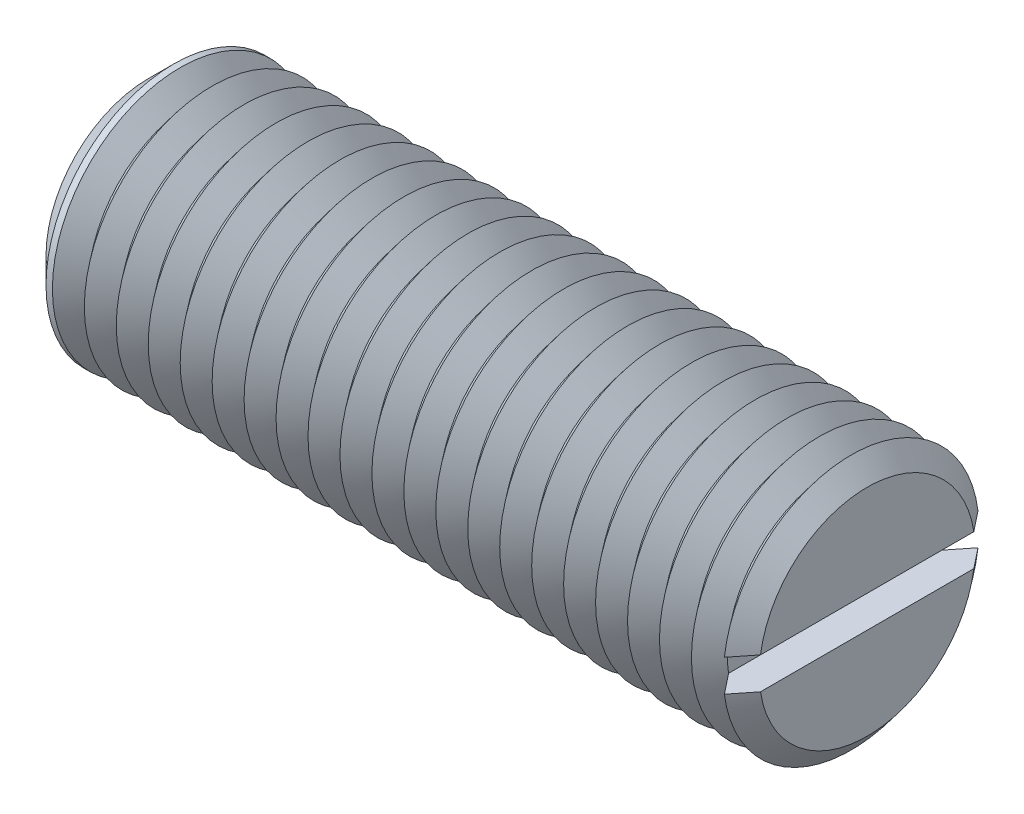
ISO-10303-21;
HEADER;
FILE_DESCRIPTION(('STEP AP214'),'2;1');
FILE_NAME('part.step','',(''),(''),'','','');
FILE_SCHEMA(('AUTOMOTIVE_DESIGN { 1 0 10303 214 1 1 1 1 }'));
ENDSEC;
DATA;
#1=APPLICATION_CONTEXT('core data for automotive mechanical design processes');
#2=APPLICATION_PROTOCOL_DEFINITION('international standard','automotive_design',2000,#1);
#3=PRODUCT_CONTEXT('',#1,'mechanical');
#4=PRODUCT('Part','Part','',(#3));
#5=PRODUCT_RELATED_PRODUCT_CATEGORY('part','',(#4));
#6=PRODUCT_DEFINITION_FORMATION('','',#4);
#7=PRODUCT_DEFINITION_CONTEXT('part definition',#1,'design');
#8=PRODUCT_DEFINITION('design','',#6,#7);
#9=PRODUCT_DEFINITION_SHAPE('','',#8);
#10=(LENGTH_UNIT() NAMED_UNIT(*) SI_UNIT(.MILLI.,.METRE.));
#11=(NAMED_UNIT(*) PLANE_ANGLE_UNIT() SI_UNIT($,.RADIAN.));
#12=(NAMED_UNIT(*) SI_UNIT($,.STERADIAN.) SOLID_ANGLE_UNIT());
#13=UNCERTAINTY_MEASURE_WITH_UNIT(LENGTH_MEASURE(1.E-05),#10,'distance_accuracy_value','');
#14=(GEOMETRIC_REPRESENTATION_CONTEXT(3) GLOBAL_UNCERTAINTY_ASSIGNED_CONTEXT((#13)) GLOBAL_UNIT_ASSIGNED_CONTEXT((#10,
#11,#12)) REPRESENTATION_CONTEXT('',''));
#15=CARTESIAN_POINT('',(0.,0.,0.));
#16=DIRECTION('',(0.,0.,1.));
#17=DIRECTION('',(1.,0.,0.));
#18=AXIS2_PLACEMENT_3D('',#15,#16,#17);
#19=CARTESIAN_POINT('',(21.5,0.,0.));
#20=DIRECTION('',(1.,0.,0.));
#21=DIRECTION('',(0.,0.,-1.));
#22=AXIS2_PLACEMENT_3D('',#19,#20,#21);
#23=CONICAL_SURFACE('',#22,8.,0.895664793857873);
#24=CARTESIAN_POINT('',(21.5,0.,0.));
#25=DIRECTION('',(-1.,0.,0.));
#26=DIRECTION('',(0.,0.,1.));
#27=AXIS2_PLACEMENT_3D('',#24,#25,#26);
#28=CIRCLE('',#27,8.);
#29=CARTESIAN_POINT('',(21.5,-1.,-7.93725393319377));
#30=VERTEX_POINT('',#29);
#31=CARTESIAN_POINT('',(21.5,-1.,7.93725393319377));
#32=VERTEX_POINT('',#31);
#33=EDGE_CURVE('E117',#30,#32,#28,.T.);
#34=ORIENTED_EDGE('',*,*,#33,.T.);
#35=CARTESIAN_POINT('',(29.1137872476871,-1.,-17.4810381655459));
#36=CARTESIAN_POINT('',(28.5731000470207,-1.,-16.8046018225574));
#37=CARTESIAN_POINT('',(28.0324624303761,-1.,-16.1281258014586));
#38=CARTESIAN_POINT('',(26.9513425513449,-1.,-14.7749910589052));
#39=CARTESIAN_POINT('',(26.4108602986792,-1.,-14.0983323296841));
#40=CARTESIAN_POINT('',(25.3295593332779,-1.,-12.7440423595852));
#41=CARTESIAN_POINT('',(24.7887409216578,-1.,-12.0664108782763));
#42=CARTESIAN_POINT('',(23.7075665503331,-1.,-10.7108366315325));
#43=CARTESIAN_POINT('',(23.1672105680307,-1.,-10.0328938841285));
#44=CARTESIAN_POINT('',(22.3866021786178,-1.,-9.05235403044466));
#45=CARTESIAN_POINT('',(22.1460332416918,-1.,-8.7500089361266));
#46=CARTESIAN_POINT('',(21.6651110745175,-1.,-8.14514467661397));
#47=CARTESIAN_POINT('',(21.4247578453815,-1.,-7.84262551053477));
#48=CARTESIAN_POINT('',(20.9443170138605,-1.,-7.23730074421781));
#49=CARTESIAN_POINT('',(20.7042294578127,-1.,-6.93449510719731));
#50=CARTESIAN_POINT('',(20.2244992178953,-1.,-6.3285404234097));
#51=CARTESIAN_POINT('',(19.9848565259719,-1.,-6.02539138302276));
#52=CARTESIAN_POINT('',(19.5064209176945,-1.,-5.41876829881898));
#53=CARTESIAN_POINT('',(19.2676275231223,-1.,-5.1152946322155));
#54=CARTESIAN_POINT('',(18.791132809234,-1.,-4.50745556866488));
#55=CARTESIAN_POINT('',(18.5534315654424,-1.,-4.20309011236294));
#56=CARTESIAN_POINT('',(18.1984723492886,-1.,-3.74537358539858));
#57=CARTESIAN_POINT('',(18.080434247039,-1.,-3.59262786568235));
#58=CARTESIAN_POINT('',(17.8451171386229,-1.,-3.28655323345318));
#59=CARTESIAN_POINT('',(17.7278381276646,-1.,-3.13322432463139));
#60=CARTESIAN_POINT('',(17.4944317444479,-1.,-2.82571819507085));
#61=CARTESIAN_POINT('',(17.3783042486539,-1.,-2.67154106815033));
#62=CARTESIAN_POINT('',(17.1478553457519,-1.,-2.36184450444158));
#63=CARTESIAN_POINT('',(17.0335338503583,-1.,-2.20632513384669));
#64=CARTESIAN_POINT('',(16.8956998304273,-1.,-2.01476175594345));
#65=CARTESIAN_POINT('',(16.8706709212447,-1.,-1.97980928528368));
#66=CARTESIAN_POINT('',(16.8208007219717,-1.,-1.90977040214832));
#67=CARTESIAN_POINT('',(16.7959594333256,-1.,-1.87468398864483));
#68=CARTESIAN_POINT('',(16.7217527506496,-1.,-1.76919140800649));
#69=CARTESIAN_POINT('',(16.6727089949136,-1.,-1.69855807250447));
#70=CARTESIAN_POINT('',(16.5751159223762,-1.,-1.55549554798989));
#71=CARTESIAN_POINT('',(16.5265831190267,-1.,-1.48305505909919));
#72=CARTESIAN_POINT('',(16.4312399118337,-1.,-1.33706835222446));
#73=CARTESIAN_POINT('',(16.3844290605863,-1.,-1.2635224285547));
#74=CARTESIAN_POINT('',(16.2926759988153,-1.,-1.11379484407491));
#75=CARTESIAN_POINT('',(16.2477706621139,-1.,-1.03759043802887));
#76=CARTESIAN_POINT('',(16.161907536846,-1.,-0.8827800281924));
#77=CARTESIAN_POINT('',(16.1209558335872,-1.,-0.804170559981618));
#78=CARTESIAN_POINT('',(16.0647846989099,-1.,-0.684500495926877));
#79=CARTESIAN_POINT('',(16.0470539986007,-1.,-0.64463151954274));
#80=CARTESIAN_POINT('',(16.0136729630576,-1.,-0.564036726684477));
#81=CARTESIAN_POINT('',(15.9980230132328,-1.,-0.523310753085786));
#82=CARTESIAN_POINT('',(15.9551526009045,-1.,-0.399956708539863));
#83=CARTESIAN_POINT('',(15.9318433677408,-1.,-0.315816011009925));
#84=CARTESIAN_POINT('',(15.9098657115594,-1.,-0.193542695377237));
#85=CARTESIAN_POINT('',(15.9047261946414,-1.,-0.156548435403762));
#86=CARTESIAN_POINT('',(15.8976757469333,-1.,-0.0822397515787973));
#87=CARTESIAN_POINT('',(15.8957650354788,-1.,-0.0449253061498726));
#88=CARTESIAN_POINT('',(15.8953106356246,-1.,0.0296935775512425));
#89=CARTESIAN_POINT('',(15.8967642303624,-1.,0.0669979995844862));
#90=CARTESIAN_POINT('',(15.902929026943,-1.,0.141334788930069));
#91=CARTESIAN_POINT('',(15.9076406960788,-1.,0.178367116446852));
#92=CARTESIAN_POINT('',(15.9224195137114,-1.,0.266117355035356));
#93=CARTESIAN_POINT('',(15.9338513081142,-1.,0.316604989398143));
#94=CARTESIAN_POINT('',(15.9613106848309,-1.,0.41630917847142));
#95=CARTESIAN_POINT('',(15.9773414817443,-1.,0.465524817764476));
#96=CARTESIAN_POINT('',(16.0130409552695,-1.,0.563049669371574));
#97=CARTESIAN_POINT('',(16.0327381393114,-1.,0.611348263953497));
#98=CARTESIAN_POINT('',(16.0747706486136,-1.,0.706748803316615));
#99=CARTESIAN_POINT('',(16.0971051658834,-1.,0.75385110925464));
#100=CARTESIAN_POINT('',(16.1464135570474,-1.,0.852405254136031));
#101=CARTESIAN_POINT('',(16.1736257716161,-1.,0.903736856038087));
#102=CARTESIAN_POINT('',(16.2298407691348,-1.,1.00541472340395));
#103=CARTESIAN_POINT('',(16.2588439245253,-1.,1.05576078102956));
#104=CARTESIAN_POINT('',(16.3478642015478,-1.,1.20570300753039));
#105=CARTESIAN_POINT('',(16.409851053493,-1.,1.30412495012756));
#106=CARTESIAN_POINT('',(16.537021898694,-1.,1.49921478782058));
#107=CARTESIAN_POINT('',(16.6022138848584,-1.,1.59587737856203));
#108=CARTESIAN_POINT('',(16.7345096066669,-1.,1.787817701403));
#109=CARTESIAN_POINT('',(16.8016124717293,-1.,1.88309603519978));
#110=CARTESIAN_POINT('',(16.9371969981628,-1.,2.07285006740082));
#111=CARTESIAN_POINT('',(17.0056803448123,-1.,2.16732455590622));
#112=CARTESIAN_POINT('',(17.1435598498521,-1.,2.35561985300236));
#113=CARTESIAN_POINT('',(17.2129561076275,-1.,2.44944058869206));
#114=CARTESIAN_POINT('',(17.3522867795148,-1.,2.63643541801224));
#115=CARTESIAN_POINT('',(17.4222200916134,-1.,2.72961033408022));
#116=CARTESIAN_POINT('',(17.5625737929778,-1.,2.91558674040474));
#117=CARTESIAN_POINT('',(17.6329941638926,-1.,3.00838824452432));
#118=CARTESIAN_POINT('',(17.8434401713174,-1.,3.28457080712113));
#119=CARTESIAN_POINT('',(17.9840068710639,-1.,3.46753938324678));
#120=CARTESIAN_POINT('',(18.2660473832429,-1.,3.83277652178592));
#121=CARTESIAN_POINT('',(18.4075212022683,-1.,4.01504507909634));
#122=CARTESIAN_POINT('',(18.832844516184,-1.,4.56116633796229));
#123=CARTESIAN_POINT('',(19.1175870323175,-1.,4.92432312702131));
#124=CARTESIAN_POINT('',(19.6884502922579,-1.,5.64994266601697));
#125=CARTESIAN_POINT('',(19.974571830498,-1.,6.01240478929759));
#126=CARTESIAN_POINT('',(20.5475166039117,-1.,6.73676512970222));
#127=CARTESIAN_POINT('',(20.8343398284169,-1.,7.09866335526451));
#128=CARTESIAN_POINT('',(21.4076446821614,-1.,7.82112227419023));
#129=CARTESIAN_POINT('',(21.6941251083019,-1.,8.18168392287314));
#130=CARTESIAN_POINT('',(22.2673842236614,-1.,8.90257236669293));
#131=CARTESIAN_POINT('',(22.5541629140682,-1.,9.26289916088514));
#132=CARTESIAN_POINT('',(23.4146958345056,-1.,10.3434977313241));
#133=CARTESIAN_POINT('',(23.9887564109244,-1.,11.0635255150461));
#134=CARTESIAN_POINT('',(24.9416309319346,-1.,12.2579358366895));
#135=CARTESIAN_POINT('',(25.3203198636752,-1.,12.7324181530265));
#136=CARTESIAN_POINT('',(26.0778600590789,-1.,13.6812951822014));
#137=CARTESIAN_POINT('',(26.4567113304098,-1.,14.1556898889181));
#138=CARTESIAN_POINT('',(27.2152320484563,-1.,15.105292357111));
#139=CARTESIAN_POINT('',(27.5949016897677,-1.,15.580499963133));
#140=CARTESIAN_POINT('',(28.3543004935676,-1.,16.5308253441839));
#141=CARTESIAN_POINT('',(28.7340296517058,-1.,17.005943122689));
#142=CARTESIAN_POINT('',(29.1137872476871,-1.,17.4810381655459));
#143=B_SPLINE_CURVE_WITH_KNOTS('',3,(#35,#36,#37,#38,#39,#40,#41,#42,#43,#44,#45,#46,#47,#48,
#49,#50,#51,#52,#53,#54,#55,#56,#57,#58,#59,#60,#61,#62,#63,#64,#65,#66,#67,#68,#69,#70,#71,#72,
#73,#74,#75,#76,#77,#78,#79,#80,#81,#82,#83,#84,#85,#86,#87,#88,#89,#90,#91,#92,#93,#94,#95,#96,
#97,#98,#99,#100,#101,#102,#103,#104,#105,#106,#107,#108,#109,#110,#111,#112,#113,#114,#115,
#116,#117,#118,#119,#120,#121,#122,#123,#124,#125,#126,#127,#128,#129,#130,#131,#132,#133,#134,
#135,#136,#137,#138,#139,#140,#141,#142),.UNSPECIFIED.,.F.,.F.,(4,2,2,2,2,2,2,2,2,2,2,2,2,2,2,2,
2,2,2,2,2,2,2,2,2,2,2,2,2,2,2,2,2,2,2,2,2,2,2,2,2,2,2,2,2,2,2,2,2,2,2,2,2,4),(0.,
2.59791825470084,5.19597381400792,7.7969391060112,10.3977690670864,11.5568952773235,
12.7160274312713,13.8753371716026,15.0346257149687,16.1931009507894,17.3516551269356,
17.9307722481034,18.5098857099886,19.0889363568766,19.6679586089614,19.7969273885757,
19.9258971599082,20.1838595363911,20.4454304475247,20.7069329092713,20.9722220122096,
21.2379131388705,21.3687577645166,21.4996265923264,21.7602408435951,21.8721711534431,
21.9841090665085,22.0959566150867,22.2078202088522,22.362827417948,22.5179432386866,
22.6743197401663,22.8306484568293,23.0048946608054,23.1791772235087,23.5280071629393,
23.8777561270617,24.2273482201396,24.5773965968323,24.927483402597,25.2769811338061,
25.6264657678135,26.3186514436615,27.0108421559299,28.3952670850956,29.7806179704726,
31.1659479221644,32.5474981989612,33.9290539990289,36.6916375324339,38.5128593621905,
40.3341796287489,42.1589376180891,43.98359654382),.UNSPECIFIED.);
#144=CARTESIAN_POINT('',(20.5,-1.,6.67652652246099));
#145=VERTEX_POINT('',#144);
#146=EDGE_CURVE('E109',#145,#32,#143,.T.);
#147=ORIENTED_EDGE('',*,*,#146,.F.);
#148=CARTESIAN_POINT('',(20.5,0.,0.));
#149=DIRECTION('',(-1.,0.,0.));
#150=DIRECTION('',(0.,0.,1.));
#151=AXIS2_PLACEMENT_3D('',#148,#149,#150);
#152=CIRCLE('',#151,6.75100040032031);
#153=CARTESIAN_POINT('',(20.5,-1.,-6.67652652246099));
#154=VERTEX_POINT('',#153);
#155=EDGE_CURVE('E392',#154,#145,#152,.T.);
#156=ORIENTED_EDGE('',*,*,#155,.F.);
#157=EDGE_CURVE('E58',#30,#154,#143,.T.);
#158=ORIENTED_EDGE('',*,*,#157,.F.);
#159=EDGE_LOOP('',(#34,#147,#156,#158));
#160=FACE_BOUND('',#159,.T.);
#161=ADVANCED_FACE('F37',(#160),#23,.T.);
#162=CARTESIAN_POINT('',(21.5,1.,7.93725393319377));
#163=VERTEX_POINT('',#162);
#164=CARTESIAN_POINT('',(21.5,1.,-7.93725393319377));
#165=VERTEX_POINT('',#164);
#166=EDGE_CURVE('E100',#163,#165,#28,.T.);
#167=ORIENTED_EDGE('',*,*,#166,.T.);
#168=CARTESIAN_POINT('',(29.1137872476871,1.,17.4810381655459));
#169=CARTESIAN_POINT('',(28.5731000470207,1.,16.8046018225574));
#170=CARTESIAN_POINT('',(28.0324624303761,1.,16.1281258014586));
#171=CARTESIAN_POINT('',(26.9513425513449,1.,14.7749910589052));
#172=CARTESIAN_POINT('',(26.4108602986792,1.,14.0983323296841));
#173=CARTESIAN_POINT('',(25.3295593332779,1.,12.7440423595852));
#174=CARTESIAN_POINT('',(24.7887409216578,1.,12.0664108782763));
#175=CARTESIAN_POINT('',(23.7075665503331,1.,10.7108366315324));
#176=CARTESIAN_POINT('',(23.1672105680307,1.,10.0328938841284));
#177=CARTESIAN_POINT('',(22.3866021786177,1.,9.05235403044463));
#178=CARTESIAN_POINT('',(22.1460332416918,1.,8.75000893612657));
#179=CARTESIAN_POINT('',(21.6651110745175,1.,8.14514467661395));
#180=CARTESIAN_POINT('',(21.4247578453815,1.,7.84262551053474));
#181=CARTESIAN_POINT('',(20.9443170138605,1.,7.23730074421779));
#182=CARTESIAN_POINT('',(20.7042294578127,1.,6.93449510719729));
#183=CARTESIAN_POINT('',(20.2244992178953,1.,6.32854042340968));
#184=CARTESIAN_POINT('',(19.9848565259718,1.,6.02539138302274));
#185=CARTESIAN_POINT('',(19.5064209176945,1.,5.41876829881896));
#186=CARTESIAN_POINT('',(19.2676275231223,1.,5.11529463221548));
#187=CARTESIAN_POINT('',(18.791132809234,1.,4.50745556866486));
#188=CARTESIAN_POINT('',(18.5534315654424,1.,4.20309011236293));
#189=CARTESIAN_POINT('',(18.1984723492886,1.,3.74537358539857));
#190=CARTESIAN_POINT('',(18.080434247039,1.,3.59262786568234));
#191=CARTESIAN_POINT('',(17.8451171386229,1.,3.28655323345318));
#192=CARTESIAN_POINT('',(17.7278381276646,1.,3.13322432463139));
#193=CARTESIAN_POINT('',(17.4944317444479,1.,2.82571819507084));
#194=CARTESIAN_POINT('',(17.3783042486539,1.,2.67154106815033));
#195=CARTESIAN_POINT('',(17.1478553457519,1.,2.36184450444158));
#196=CARTESIAN_POINT('',(17.0335338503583,1.,2.20632513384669));
#197=CARTESIAN_POINT('',(16.8956998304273,1.,2.01476175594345));
#198=CARTESIAN_POINT('',(16.8706709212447,1.,1.97980928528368));
#199=CARTESIAN_POINT('',(16.8208007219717,1.,1.90977040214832));
#200=CARTESIAN_POINT('',(16.7959594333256,1.,1.87468398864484));
#201=CARTESIAN_POINT('',(16.7217527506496,1.,1.76919140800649));
#202=CARTESIAN_POINT('',(16.6727089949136,1.,1.69855807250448));
#203=CARTESIAN_POINT('',(16.5751159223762,1.,1.5554955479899));
#204=CARTESIAN_POINT('',(16.5265831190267,1.,1.4830550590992));
#205=CARTESIAN_POINT('',(16.4312399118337,1.,1.33706835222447));
#206=CARTESIAN_POINT('',(16.3844290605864,1.,1.2635224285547));
#207=CARTESIAN_POINT('',(16.2926759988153,1.,1.11379484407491));
#208=CARTESIAN_POINT('',(16.2477706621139,1.,1.03759043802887));
#209=CARTESIAN_POINT('',(16.161907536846,1.,0.882780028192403));
#210=CARTESIAN_POINT('',(16.1209558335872,1.,0.804170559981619));
#211=CARTESIAN_POINT('',(16.0647846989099,1.,0.684500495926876));
#212=CARTESIAN_POINT('',(16.0470539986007,1.,0.644631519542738));
#213=CARTESIAN_POINT('',(16.0136729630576,1.,0.564036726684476));
#214=CARTESIAN_POINT('',(15.9980230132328,1.,0.523310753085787));
#215=CARTESIAN_POINT('',(15.9551526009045,1.,0.399956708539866));
#216=CARTESIAN_POINT('',(15.9318433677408,1.,0.315816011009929));
#217=CARTESIAN_POINT('',(15.9098657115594,1.,0.19354269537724));
#218=CARTESIAN_POINT('',(15.9047261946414,1.,0.156548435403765));
#219=CARTESIAN_POINT('',(15.8976757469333,1.,0.0822397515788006));
#220=CARTESIAN_POINT('',(15.8957650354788,1.,0.0449253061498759));
#221=CARTESIAN_POINT('',(15.8953106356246,1.,-0.0296935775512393));
#222=CARTESIAN_POINT('',(15.8967642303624,1.,-0.066997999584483));
#223=CARTESIAN_POINT('',(15.902929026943,1.,-0.141334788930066));
#224=CARTESIAN_POINT('',(15.9076406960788,1.,-0.178367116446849));
#225=CARTESIAN_POINT('',(15.9224195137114,1.,-0.266117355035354));
#226=CARTESIAN_POINT('',(15.9338513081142,1.,-0.31660498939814));
#227=CARTESIAN_POINT('',(15.9613106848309,1.,-0.416309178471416));
#228=CARTESIAN_POINT('',(15.9773414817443,1.,-0.465524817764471));
#229=CARTESIAN_POINT('',(16.0130409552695,1.,-0.563049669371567));
#230=CARTESIAN_POINT('',(16.0327381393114,1.,-0.611348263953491));
#231=CARTESIAN_POINT('',(16.0747706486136,1.,-0.706748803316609));
#232=CARTESIAN_POINT('',(16.0971051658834,1.,-0.753851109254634));
#233=CARTESIAN_POINT('',(16.1464135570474,1.,-0.852405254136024));
#234=CARTESIAN_POINT('',(16.1736257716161,1.,-0.903736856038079));
#235=CARTESIAN_POINT('',(16.2298407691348,1.,-1.00541472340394));
#236=CARTESIAN_POINT('',(16.2588439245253,1.,-1.05576078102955));
#237=CARTESIAN_POINT('',(16.3478642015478,1.,-1.20570300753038));
#238=CARTESIAN_POINT('',(16.409851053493,1.,-1.30412495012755));
#239=CARTESIAN_POINT('',(16.537021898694,1.,-1.49921478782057));
#240=CARTESIAN_POINT('',(16.6022138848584,1.,-1.59587737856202));
#241=CARTESIAN_POINT('',(16.7345096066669,1.,-1.78781770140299));
#242=CARTESIAN_POINT('',(16.8016124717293,1.,-1.88309603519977));
#243=CARTESIAN_POINT('',(16.9371969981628,1.,-2.0728500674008));
#244=CARTESIAN_POINT('',(17.0056803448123,1.,-2.16732455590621));
#245=CARTESIAN_POINT('',(17.1435598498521,1.,-2.35561985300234));
#246=CARTESIAN_POINT('',(17.2129561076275,1.,-2.44944058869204));
#247=CARTESIAN_POINT('',(17.3522867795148,1.,-2.63643541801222));
#248=CARTESIAN_POINT('',(17.4222200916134,1.,-2.7296103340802));
#249=CARTESIAN_POINT('',(17.5625737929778,1.,-2.91558674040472));
#250=CARTESIAN_POINT('',(17.6329941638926,1.,-3.0083882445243));
#251=CARTESIAN_POINT('',(17.8434401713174,1.,-3.28457080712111));
#252=CARTESIAN_POINT('',(17.9840068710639,1.,-3.46753938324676));
#253=CARTESIAN_POINT('',(18.2660473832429,1.,-3.83277652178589));
#254=CARTESIAN_POINT('',(18.4075212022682,1.,-4.01504507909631));
#255=CARTESIAN_POINT('',(18.832844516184,1.,-4.56116633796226));
#256=CARTESIAN_POINT('',(19.1175870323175,1.,-4.92432312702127));
#257=CARTESIAN_POINT('',(19.6884502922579,1.,-5.64994266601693));
#258=CARTESIAN_POINT('',(19.9745718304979,1.,-6.01240478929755));
#259=CARTESIAN_POINT('',(20.5475166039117,1.,-6.73676512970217));
#260=CARTESIAN_POINT('',(20.8343398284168,1.,-7.09866335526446));
#261=CARTESIAN_POINT('',(21.4076446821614,1.,-7.82112227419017));
#262=CARTESIAN_POINT('',(21.6941251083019,1.,-8.18168392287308));
#263=CARTESIAN_POINT('',(22.2673842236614,1.,-8.90257236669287));
#264=CARTESIAN_POINT('',(22.5541629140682,1.,-9.26289916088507));
#265=CARTESIAN_POINT('',(23.4146958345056,1.,-10.343497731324));
#266=CARTESIAN_POINT('',(23.9887564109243,1.,-11.063525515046));
#267=CARTESIAN_POINT('',(24.9416309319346,1.,-12.2579358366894));
#268=CARTESIAN_POINT('',(25.3203198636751,1.,-12.7324181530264));
#269=CARTESIAN_POINT('',(26.0778600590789,1.,-13.6812951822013));
#270=CARTESIAN_POINT('',(26.4567113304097,1.,-14.1556898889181));
#271=CARTESIAN_POINT('',(27.2152320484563,1.,-15.1052923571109));
#272=CARTESIAN_POINT('',(27.5949016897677,1.,-15.580499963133));
#273=CARTESIAN_POINT('',(28.3543004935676,1.,-16.5308253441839));
#274=CARTESIAN_POINT('',(28.7340296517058,1.,-17.005943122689));
#275=CARTESIAN_POINT('',(29.1137872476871,1.,-17.4810381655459));
#276=B_SPLINE_CURVE_WITH_KNOTS('',3,(#168,#169,#170,#171,#172,#173,#174,#175,#176,#177,#178,
#179,#180,#181,#182,#183,#184,#185,#186,#187,#188,#189,#190,#191,#192,#193,#194,#195,#196,#197,
#198,#199,#200,#201,#202,#203,#204,#205,#206,#207,#208,#209,#210,#211,#212,#213,#214,#215,#216,
#217,#218,#219,#220,#221,#222,#223,#224,#225,#226,#227,#228,#229,#230,#231,#232,#233,#234,#235,
#236,#237,#238,#239,#240,#241,#242,#243,#244,#245,#246,#247,#248,#249,#250,#251,#252,#253,#254,
#255,#256,#257,#258,#259,#260,#261,#262,#263,#264,#265,#266,#267,#268,#269,#270,#271,#272,#273,
#274,#275),.UNSPECIFIED.,.F.,.F.,(4,2,2,2,2,2,2,2,2,2,2,2,2,2,2,2,2,2,2,2,2,2,2,2,2,2,2,2,2,2,2,
2,2,2,2,2,2,2,2,2,2,2,2,2,2,2,2,2,2,2,2,2,2,4),(0.,2.59791825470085,5.19597381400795,
7.79693910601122,10.3977690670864,11.5568952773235,12.7160274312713,13.8753371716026,
15.0346257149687,16.1931009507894,17.3516551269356,17.9307722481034,18.5098857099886,
19.0889363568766,19.6679586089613,19.7969273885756,19.9258971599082,20.1838595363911,
20.4454304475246,20.7069329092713,20.9722220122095,21.2379131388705,21.3687577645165,
21.4996265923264,21.7602408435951,21.8721711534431,21.9841090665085,22.0959566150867,
22.2078202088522,22.3628274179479,22.5179432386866,22.6743197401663,22.8306484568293,
23.0048946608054,23.1791772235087,23.5280071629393,23.8777561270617,24.2273482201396,
24.5773965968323,24.927483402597,25.276981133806,25.6264657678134,26.3186514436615,
27.0108421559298,28.3952670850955,29.7806179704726,31.1659479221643,32.5474981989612,
33.9290539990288,36.6916375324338,38.5128593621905,40.3341796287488,42.1589376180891,
43.98359654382),.UNSPECIFIED.);
#277=CARTESIAN_POINT('',(20.5,1.,-6.67652652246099));
#278=VERTEX_POINT('',#277);
#279=EDGE_CURVE('E110',#278,#165,#276,.T.);
#280=ORIENTED_EDGE('',*,*,#279,.F.);
#281=CARTESIAN_POINT('',(20.5,1.,6.67652652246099));
#282=VERTEX_POINT('',#281);
#283=EDGE_CURVE('E103',#282,#278,#152,.T.);
#284=ORIENTED_EDGE('',*,*,#283,.F.);
#285=EDGE_CURVE('E97',#163,#282,#276,.T.);
#286=ORIENTED_EDGE('',*,*,#285,.F.);
#287=EDGE_LOOP('',(#167,#280,#284,#286));
#288=FACE_BOUND('',#287,.T.);
#289=ADVANCED_FACE('F99',(#288),#23,.T.);
#290=CARTESIAN_POINT('',(20.5,0.,0.));
#291=DIRECTION('',(-1.,0.,0.));
#292=DIRECTION('',(0.,0.,1.));
#293=AXIS2_PLACEMENT_3D('',#290,#291,#292);
#294=CONICAL_SURFACE('',#293,6.75100040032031,0.895664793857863);
#295=CARTESIAN_POINT('',(19.5,0.,0.));
#296=DIRECTION('',(-1.,0.,0.));
#297=DIRECTION('',(0.,0.,1.));
#298=AXIS2_PLACEMENT_3D('',#295,#296,#297);
#299=CIRCLE('',#298,8.);
#300=CARTESIAN_POINT('',(19.5,0.,8.));
#301=VERTEX_POINT('',#300);
#302=EDGE_CURVE('E381',#301,#301,#299,.T.);
#303=ORIENTED_EDGE('',*,*,#302,.F.);
#304=EDGE_LOOP('',(#303));
#305=FACE_BOUND('',#304,.T.);
#306=ORIENTED_EDGE('',*,*,#283,.T.);
#307=EDGE_CURVE('E388',#278,#154,#152,.T.);
#308=ORIENTED_EDGE('',*,*,#307,.T.);
#309=ORIENTED_EDGE('',*,*,#155,.T.);
#310=EDGE_CURVE('E387',#145,#282,#152,.T.);
#311=ORIENTED_EDGE('',*,*,#310,.T.);
#312=EDGE_LOOP('',(#306,#308,#309,#311));
#313=FACE_BOUND('',#312,.T.);
#314=ADVANCED_FACE('F166',(#305,#313),#294,.T.);
#315=CARTESIAN_POINT('',(22.5,0.,0.));
#316=DIRECTION('',(1.,0.,0.));
#317=DIRECTION('',(0.,0.,-1.));
#318=AXIS2_PLACEMENT_3D('',#315,#316,#317);
#319=PLANE('',#318);
#320=CARTESIAN_POINT('',(22.5,0.,0.));
#321=DIRECTION('',(-1.,0.,0.));
#322=DIRECTION('',(0.,0.,1.));
#323=AXIS2_PLACEMENT_3D('',#320,#321,#322);
#324=CIRCLE('',#323,6.75100040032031);
#325=CARTESIAN_POINT('',(22.5,1.,6.67652652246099));
#326=VERTEX_POINT('',#325);
#327=CARTESIAN_POINT('',(22.5,1.,-6.67652652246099));
#328=VERTEX_POINT('',#327);
#329=EDGE_CURVE('E158',#326,#328,#324,.T.);
#330=ORIENTED_EDGE('',*,*,#329,.F.);
#331=DIRECTION('',(0.,0.,1.));
#332=VECTOR('',#331,1.);
#333=CARTESIAN_POINT('',(22.5,1.,0.));
#334=LINE('',#333,#332);
#335=EDGE_CURVE('E122',#328,#326,#334,.T.);
#336=ORIENTED_EDGE('',*,*,#335,.F.);
#337=EDGE_LOOP('',(#330,#336));
#338=FACE_BOUND('',#337,.T.);
#339=ADVANCED_FACE('F170',(#338),#319,.T.);
#340=CARTESIAN_POINT('',(22.5,-1.,-6.67652652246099));
#341=VERTEX_POINT('',#340);
#342=CARTESIAN_POINT('',(22.5,-1.,6.67652652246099));
#343=VERTEX_POINT('',#342);
#344=EDGE_CURVE('E66',#341,#343,#324,.T.);
#345=ORIENTED_EDGE('',*,*,#344,.F.);
#346=DIRECTION('',(0.,0.,-1.));
#347=VECTOR('',#346,1.);
#348=CARTESIAN_POINT('',(22.5,-1.,0.));
#349=LINE('',#348,#347);
#350=EDGE_CURVE('E135',#343,#341,#349,.T.);
#351=ORIENTED_EDGE('',*,*,#350,.F.);
#352=EDGE_LOOP('',(#345,#351));
#353=FACE_BOUND('',#352,.T.);
#354=ADVANCED_FACE('F199',(#353),#319,.T.);
#355=CARTESIAN_POINT('',(22.5,0.,0.));
#356=DIRECTION('',(-1.,0.,0.));
#357=DIRECTION('',(0.,0.,1.));
#358=AXIS2_PLACEMENT_3D('',#355,#356,#357);
#359=CONICAL_SURFACE('',#358,6.75100040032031,0.895664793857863);
#360=ORIENTED_EDGE('',*,*,#166,.F.);
#361=CARTESIAN_POINT('',(13.8862127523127,1.,-17.4810381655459));
#362=CARTESIAN_POINT('',(14.4268999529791,1.,-16.8046018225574));
#363=CARTESIAN_POINT('',(14.9675375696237,1.,-16.1281258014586));
#364=CARTESIAN_POINT('',(16.0486574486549,1.,-14.7749910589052));
#365=CARTESIAN_POINT('',(16.5891397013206,1.,-14.0983323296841));
#366=CARTESIAN_POINT('',(17.6704406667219,1.,-12.7440423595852));
#367=CARTESIAN_POINT('',(18.211259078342,1.,-12.0664108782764));
#368=CARTESIAN_POINT('',(19.2924334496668,1.,-10.7108366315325));
#369=CARTESIAN_POINT('',(19.8327894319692,1.,-10.0328938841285));
#370=CARTESIAN_POINT('',(20.6133978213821,1.,-9.05235403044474));
#371=CARTESIAN_POINT('',(20.8539667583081,1.,-8.75000893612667));
#372=CARTESIAN_POINT('',(21.3348889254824,1.,-8.14514467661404));
#373=CARTESIAN_POINT('',(21.5752421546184,1.,-7.84262551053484));
#374=CARTESIAN_POINT('',(22.0556829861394,1.,-7.23730074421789));
#375=CARTESIAN_POINT('',(22.2957705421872,1.,-6.93449510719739));
#376=CARTESIAN_POINT('',(22.7755007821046,1.,-6.32854042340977));
#377=CARTESIAN_POINT('',(23.0151434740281,1.,-6.02539138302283));
#378=CARTESIAN_POINT('',(23.4935790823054,1.,-5.41876829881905));
#379=CARTESIAN_POINT('',(23.7323724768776,1.,-5.11529463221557));
#380=CARTESIAN_POINT('',(24.208867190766,1.,-4.50745556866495));
#381=CARTESIAN_POINT('',(24.4465684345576,1.,-4.20309011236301));
#382=CARTESIAN_POINT('',(24.8015276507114,1.,-3.74537358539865));
#383=CARTESIAN_POINT('',(24.919565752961,1.,-3.59262786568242));
#384=CARTESIAN_POINT('',(25.1548828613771,1.,-3.28655323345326));
#385=CARTESIAN_POINT('',(25.2721618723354,1.,-3.13322432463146));
#386=CARTESIAN_POINT('',(25.5055682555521,1.,-2.82571819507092));
#387=CARTESIAN_POINT('',(25.6216957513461,1.,-2.6715410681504));
#388=CARTESIAN_POINT('',(25.8521446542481,1.,-2.36184450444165));
#389=CARTESIAN_POINT('',(25.9664661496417,1.,-2.20632513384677));
#390=CARTESIAN_POINT('',(26.1043001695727,1.,-2.01476175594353));
#391=CARTESIAN_POINT('',(26.1293290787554,1.,-1.97980928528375));
#392=CARTESIAN_POINT('',(26.1791992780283,1.,-1.90977040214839));
#393=CARTESIAN_POINT('',(26.2040405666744,1.,-1.87468398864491));
#394=CARTESIAN_POINT('',(26.2782472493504,1.,-1.76919140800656));
#395=CARTESIAN_POINT('',(26.3272910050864,1.,-1.69855807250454));
#396=CARTESIAN_POINT('',(26.4248840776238,1.,-1.55549554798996));
#397=CARTESIAN_POINT('',(26.4734168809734,1.,-1.48305505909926));
#398=CARTESIAN_POINT('',(26.5687600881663,1.,-1.33706835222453));
#399=CARTESIAN_POINT('',(26.6155709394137,1.,-1.26352242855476));
#400=CARTESIAN_POINT('',(26.7073240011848,1.,-1.11379484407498));
#401=CARTESIAN_POINT('',(26.7522293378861,1.,-1.03759043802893));
#402=CARTESIAN_POINT('',(26.8380924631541,1.,-0.882780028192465));
#403=CARTESIAN_POINT('',(26.8790441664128,1.,-0.804170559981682));
#404=CARTESIAN_POINT('',(26.9352153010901,1.,-0.684500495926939));
#405=CARTESIAN_POINT('',(26.9529460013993,1.,-0.644631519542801));
#406=CARTESIAN_POINT('',(26.9863270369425,1.,-0.564036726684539));
#407=CARTESIAN_POINT('',(27.0019769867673,1.,-0.523310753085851));
#408=CARTESIAN_POINT('',(27.0448473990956,1.,-0.399956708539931));
#409=CARTESIAN_POINT('',(27.0681566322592,1.,-0.315816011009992));
#410=CARTESIAN_POINT('',(27.0901342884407,1.,-0.193542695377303));
#411=CARTESIAN_POINT('',(27.0952738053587,1.,-0.15654843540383));
#412=CARTESIAN_POINT('',(27.1023242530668,1.,-0.0822397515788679));
#413=CARTESIAN_POINT('',(27.1042349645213,1.,-0.0449253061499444));
#414=CARTESIAN_POINT('',(27.1046893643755,1.,0.0296935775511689));
#415=CARTESIAN_POINT('',(27.1032357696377,1.,0.0669979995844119));
#416=CARTESIAN_POINT('',(27.0970709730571,1.,0.141334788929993));
#417=CARTESIAN_POINT('',(27.0923593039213,1.,0.178367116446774));
#418=CARTESIAN_POINT('',(27.0775804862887,1.,0.266117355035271));
#419=CARTESIAN_POINT('',(27.0661486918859,1.,0.316604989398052));
#420=CARTESIAN_POINT('',(27.0386893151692,1.,0.416309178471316));
#421=CARTESIAN_POINT('',(27.0226585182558,1.,0.465524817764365));
#422=CARTESIAN_POINT('',(26.9869590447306,1.,0.563049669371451));
#423=CARTESIAN_POINT('',(26.9672618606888,1.,0.611348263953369));
#424=CARTESIAN_POINT('',(26.9252293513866,1.,0.706748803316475));
#425=CARTESIAN_POINT('',(26.9028948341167,1.,0.753851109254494));
#426=CARTESIAN_POINT('',(26.8535864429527,1.,0.85240525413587));
#427=CARTESIAN_POINT('',(26.8263742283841,1.,0.903736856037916));
#428=CARTESIAN_POINT('',(26.7701592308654,1.,1.00541472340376));
#429=CARTESIAN_POINT('',(26.7411560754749,1.,1.05576078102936));
#430=CARTESIAN_POINT('',(26.6521357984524,1.,1.20570300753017));
#431=CARTESIAN_POINT('',(26.5901489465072,1.,1.30412495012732));
#432=CARTESIAN_POINT('',(26.4629781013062,1.,1.4992147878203));
#433=CARTESIAN_POINT('',(26.3977861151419,1.,1.59587737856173));
#434=CARTESIAN_POINT('',(26.2654903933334,1.,1.78781770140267));
#435=CARTESIAN_POINT('',(26.198387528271,1.,1.88309603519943));
#436=CARTESIAN_POINT('',(26.0628030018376,1.,2.07285006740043));
#437=CARTESIAN_POINT('',(25.9943196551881,1.,2.16732455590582));
#438=CARTESIAN_POINT('',(25.8564401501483,1.,2.35561985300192));
#439=CARTESIAN_POINT('',(25.7870438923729,1.,2.44944058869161));
#440=CARTESIAN_POINT('',(25.6477132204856,1.,2.63643541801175));
#441=CARTESIAN_POINT('',(25.577779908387,1.,2.72961033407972));
#442=CARTESIAN_POINT('',(25.4374262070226,1.,2.9155867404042));
#443=CARTESIAN_POINT('',(25.3670058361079,1.,3.00838824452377));
#444=CARTESIAN_POINT('',(25.1565598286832,1.,3.28457080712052));
#445=CARTESIAN_POINT('',(25.0159931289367,1.,3.46753938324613));
#446=CARTESIAN_POINT('',(24.7339526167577,1.,3.83277652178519));
#447=CARTESIAN_POINT('',(24.5924787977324,1.,4.01504507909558));
#448=CARTESIAN_POINT('',(24.1671554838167,1.,4.56116633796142));
#449=CARTESIAN_POINT('',(23.8824129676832,1.,4.92432312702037));
#450=CARTESIAN_POINT('',(23.311549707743,1.,5.64994266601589));
#451=CARTESIAN_POINT('',(23.025428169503,1.,6.01240478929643));
#452=CARTESIAN_POINT('',(22.4524833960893,1.,6.73676512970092));
#453=CARTESIAN_POINT('',(22.1656601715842,1.,7.09866335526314));
#454=CARTESIAN_POINT('',(21.5923553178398,1.,7.82112227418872));
#455=CARTESIAN_POINT('',(21.3058748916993,1.,8.18168392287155));
#456=CARTESIAN_POINT('',(20.7326157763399,1.,8.9025723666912));
#457=CARTESIAN_POINT('',(20.4458370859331,1.,9.26289916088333));
#458=CARTESIAN_POINT('',(19.5853041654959,1.,10.3434977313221));
#459=CARTESIAN_POINT('',(19.0112435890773,1.,11.0635255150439));
#460=CARTESIAN_POINT('',(18.058369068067,1.,12.2579358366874));
#461=CARTESIAN_POINT('',(17.6796801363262,1.,12.7324181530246));
#462=CARTESIAN_POINT('',(16.9221399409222,1.,13.6812951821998));
#463=CARTESIAN_POINT('',(16.5432886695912,1.,14.1556898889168));
#464=CARTESIAN_POINT('',(15.7847679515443,1.,15.10529235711));
#465=CARTESIAN_POINT('',(15.4050983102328,1.,15.5804999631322));
#466=CARTESIAN_POINT('',(14.6456995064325,1.,16.5308253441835));
#467=CARTESIAN_POINT('',(14.2659703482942,1.,17.0059431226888));
#468=CARTESIAN_POINT('',(13.8862127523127,1.,17.4810381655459));
#469=B_SPLINE_CURVE_WITH_KNOTS('',3,(#361,#362,#363,#364,#365,#366,#367,#368,#369,#370,#371,
#372,#373,#374,#375,#376,#377,#378,#379,#380,#381,#382,#383,#384,#385,#386,#387,#388,#389,#390,
#391,#392,#393,#394,#395,#396,#397,#398,#399,#400,#401,#402,#403,#404,#405,#406,#407,#408,#409,
#410,#411,#412,#413,#414,#415,#416,#417,#418,#419,#420,#421,#422,#423,#424,#425,#426,#427,#428,
#429,#430,#431,#432,#433,#434,#435,#436,#437,#438,#439,#440,#441,#442,#443,#444,#445,#446,#447,
#448,#449,#450,#451,#452,#453,#454,#455,#456,#457,#458,#459,#460,#461,#462,#463,#464,#465,#466,
#467,#468),.UNSPECIFIED.,.F.,.F.,(4,2,2,2,2,2,2,2,2,2,2,2,2,2,2,2,2,2,2,2,2,2,2,2,2,2,2,2,2,2,2,
2,2,2,2,2,2,2,2,2,2,2,2,2,2,2,2,2,2,2,2,2,2,4),(0.,2.59791825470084,5.19597381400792,
7.79693910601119,10.3977690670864,11.5568952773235,12.7160274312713,13.8753371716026,
15.0346257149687,16.1931009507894,17.3516551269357,17.9307722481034,18.5098857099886,
19.0889363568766,19.6679586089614,19.7969273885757,19.9258971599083,20.1838595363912,
20.4454304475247,20.7069329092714,20.9722220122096,21.2379131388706,21.3687577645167,
21.4996265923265,21.7602408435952,21.8721711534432,21.9841090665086,22.0959566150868,
22.2078202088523,22.362827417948,22.5179432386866,22.6743197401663,22.8306484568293,
23.0048946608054,23.1791772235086,23.5280071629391,23.8777561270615,24.2273482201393,
24.577396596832,24.9274834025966,25.2769811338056,25.6264657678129,26.3186514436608,
27.010842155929,28.3952670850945,29.7806179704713,31.1659479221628,32.5474981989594,
33.9290539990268,36.6916375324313,38.5128593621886,40.3341796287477,42.1589376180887,
43.9835965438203),.UNSPECIFIED.);
#470=EDGE_CURVE('E41',#326,#163,#469,.T.);
#471=ORIENTED_EDGE('',*,*,#470,.F.);
#472=ORIENTED_EDGE('',*,*,#329,.T.);
#473=EDGE_CURVE('E11',#165,#328,#469,.T.);
#474=ORIENTED_EDGE('',*,*,#473,.F.);
#475=EDGE_LOOP('',(#360,#471,#472,#474));
#476=FACE_BOUND('',#475,.T.);
#477=ADVANCED_FACE('F114',(#476),#359,.T.);
#478=CARTESIAN_POINT('',(22.5,1.,-12.));
#479=DIRECTION('',(0.,1.,0.));
#480=DIRECTION('',(0.,0.,1.));
#481=AXIS2_PLACEMENT_3D('',#478,#479,#480);
#482=PLANE('',#481);
#483=ORIENTED_EDGE('',*,*,#470,.T.);
#484=ORIENTED_EDGE('',*,*,#285,.T.);
#485=DIRECTION('',(0.,0.,1.));
#486=VECTOR('',#485,1.);
#487=CARTESIAN_POINT('',(20.5,1.,-12.));
#488=LINE('',#487,#486);
#489=EDGE_CURVE('E144',#278,#282,#488,.T.);
#490=ORIENTED_EDGE('',*,*,#489,.F.);
#491=ORIENTED_EDGE('',*,*,#279,.T.);
#492=ORIENTED_EDGE('',*,*,#473,.T.);
#493=ORIENTED_EDGE('',*,*,#335,.T.);
#494=EDGE_LOOP('',(#483,#484,#490,#491,#492,#493));
#495=FACE_BOUND('',#494,.T.);
#496=ADVANCED_FACE('F120',(#495),#482,.F.);
#497=ORIENTED_EDGE('',*,*,#33,.F.);
#498=CARTESIAN_POINT('',(13.8862127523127,-1.,17.4810381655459));
#499=CARTESIAN_POINT('',(14.4268999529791,-1.,16.8046018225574));
#500=CARTESIAN_POINT('',(14.9675375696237,-1.,16.1281258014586));
#501=CARTESIAN_POINT('',(16.0486574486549,-1.,14.7749910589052));
#502=CARTESIAN_POINT('',(16.5891397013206,-1.,14.0983323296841));
#503=CARTESIAN_POINT('',(17.6704406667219,-1.,12.7440423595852));
#504=CARTESIAN_POINT('',(18.211259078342,-1.,12.0664108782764));
#505=CARTESIAN_POINT('',(19.2924334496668,-1.,10.7108366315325));
#506=CARTESIAN_POINT('',(19.8327894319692,-1.,10.0328938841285));
#507=CARTESIAN_POINT('',(20.6133978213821,-1.,9.05235403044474));
#508=CARTESIAN_POINT('',(20.8539667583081,-1.,8.75000893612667));
#509=CARTESIAN_POINT('',(21.3348889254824,-1.,8.14514467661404));
#510=CARTESIAN_POINT('',(21.5752421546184,-1.,7.84262551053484));
#511=CARTESIAN_POINT('',(22.0556829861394,-1.,7.23730074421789));
#512=CARTESIAN_POINT('',(22.2957705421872,-1.,6.93449510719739));
#513=CARTESIAN_POINT('',(22.7755007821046,-1.,6.32854042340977));
#514=CARTESIAN_POINT('',(23.0151434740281,-1.,6.02539138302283));
#515=CARTESIAN_POINT('',(23.4935790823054,-1.,5.41876829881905));
#516=CARTESIAN_POINT('',(23.7323724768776,-1.,5.11529463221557));
#517=CARTESIAN_POINT('',(24.208867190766,-1.,4.50745556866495));
#518=CARTESIAN_POINT('',(24.4465684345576,-1.,4.20309011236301));
#519=CARTESIAN_POINT('',(24.8015276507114,-1.,3.74537358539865));
#520=CARTESIAN_POINT('',(24.919565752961,-1.,3.59262786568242));
#521=CARTESIAN_POINT('',(25.1548828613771,-1.,3.28655323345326));
#522=CARTESIAN_POINT('',(25.2721618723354,-1.,3.13322432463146));
#523=CARTESIAN_POINT('',(25.5055682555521,-1.,2.82571819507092));
#524=CARTESIAN_POINT('',(25.6216957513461,-1.,2.6715410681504));
#525=CARTESIAN_POINT('',(25.8521446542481,-1.,2.36184450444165));
#526=CARTESIAN_POINT('',(25.9664661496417,-1.,2.20632513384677));
#527=CARTESIAN_POINT('',(26.1043001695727,-1.,2.01476175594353));
#528=CARTESIAN_POINT('',(26.1293290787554,-1.,1.97980928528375));
#529=CARTESIAN_POINT('',(26.1791992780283,-1.,1.90977040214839));
#530=CARTESIAN_POINT('',(26.2040405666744,-1.,1.87468398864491));
#531=CARTESIAN_POINT('',(26.2782472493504,-1.,1.76919140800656));
#532=CARTESIAN_POINT('',(26.3272910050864,-1.,1.69855807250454));
#533=CARTESIAN_POINT('',(26.4248840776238,-1.,1.55549554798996));
#534=CARTESIAN_POINT('',(26.4734168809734,-1.,1.48305505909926));
#535=CARTESIAN_POINT('',(26.5687600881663,-1.,1.33706835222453));
#536=CARTESIAN_POINT('',(26.6155709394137,-1.,1.26352242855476));
#537=CARTESIAN_POINT('',(26.7073240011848,-1.,1.11379484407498));
#538=CARTESIAN_POINT('',(26.7522293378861,-1.,1.03759043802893));
#539=CARTESIAN_POINT('',(26.8380924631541,-1.,0.882780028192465));
#540=CARTESIAN_POINT('',(26.8790441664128,-1.,0.804170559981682));
#541=CARTESIAN_POINT('',(26.9352153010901,-1.,0.684500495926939));
#542=CARTESIAN_POINT('',(26.9529460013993,-1.,0.644631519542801));
#543=CARTESIAN_POINT('',(26.9863270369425,-1.,0.564036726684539));
#544=CARTESIAN_POINT('',(27.0019769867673,-1.,0.523310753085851));
#545=CARTESIAN_POINT('',(27.0448473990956,-1.,0.399956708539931));
#546=CARTESIAN_POINT('',(27.0681566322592,-1.,0.315816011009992));
#547=CARTESIAN_POINT('',(27.0901342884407,-1.,0.193542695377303));
#548=CARTESIAN_POINT('',(27.0952738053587,-1.,0.15654843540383));
#549=CARTESIAN_POINT('',(27.1023242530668,-1.,0.0822397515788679));
#550=CARTESIAN_POINT('',(27.1042349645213,-1.,0.0449253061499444));
#551=CARTESIAN_POINT('',(27.1046893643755,-1.,-0.0296935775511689));
#552=CARTESIAN_POINT('',(27.1032357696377,-1.,-0.0669979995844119));
#553=CARTESIAN_POINT('',(27.0970709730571,-1.,-0.141334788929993));
#554=CARTESIAN_POINT('',(27.0923593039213,-1.,-0.178367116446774));
#555=CARTESIAN_POINT('',(27.0775804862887,-1.,-0.266117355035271));
#556=CARTESIAN_POINT('',(27.0661486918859,-1.,-0.316604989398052));
#557=CARTESIAN_POINT('',(27.0386893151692,-1.,-0.416309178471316));
#558=CARTESIAN_POINT('',(27.0226585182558,-1.,-0.465524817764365));
#559=CARTESIAN_POINT('',(26.9869590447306,-1.,-0.563049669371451));
#560=CARTESIAN_POINT('',(26.9672618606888,-1.,-0.611348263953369));
#561=CARTESIAN_POINT('',(26.9252293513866,-1.,-0.706748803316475));
#562=CARTESIAN_POINT('',(26.9028948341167,-1.,-0.753851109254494));
#563=CARTESIAN_POINT('',(26.8535864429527,-1.,-0.85240525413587));
#564=CARTESIAN_POINT('',(26.8263742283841,-1.,-0.903736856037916));
#565=CARTESIAN_POINT('',(26.7701592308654,-1.,-1.00541472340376));
#566=CARTESIAN_POINT('',(26.7411560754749,-1.,-1.05576078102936));
#567=CARTESIAN_POINT('',(26.6521357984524,-1.,-1.20570300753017));
#568=CARTESIAN_POINT('',(26.5901489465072,-1.,-1.30412495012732));
#569=CARTESIAN_POINT('',(26.4629781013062,-1.,-1.4992147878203));
#570=CARTESIAN_POINT('',(26.3977861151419,-1.,-1.59587737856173));
#571=CARTESIAN_POINT('',(26.2654903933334,-1.,-1.78781770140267));
#572=CARTESIAN_POINT('',(26.198387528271,-1.,-1.88309603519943));
#573=CARTESIAN_POINT('',(26.0628030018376,-1.,-2.07285006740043));
#574=CARTESIAN_POINT('',(25.9943196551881,-1.,-2.16732455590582));
#575=CARTESIAN_POINT('',(25.8564401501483,-1.,-2.35561985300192));
#576=CARTESIAN_POINT('',(25.7870438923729,-1.,-2.44944058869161));
#577=CARTESIAN_POINT('',(25.6477132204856,-1.,-2.63643541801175));
#578=CARTESIAN_POINT('',(25.577779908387,-1.,-2.72961033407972));
#579=CARTESIAN_POINT('',(25.4374262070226,-1.,-2.9155867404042));
#580=CARTESIAN_POINT('',(25.3670058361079,-1.,-3.00838824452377));
#581=CARTESIAN_POINT('',(25.1565598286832,-1.,-3.28457080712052));
#582=CARTESIAN_POINT('',(25.0159931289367,-1.,-3.46753938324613));
#583=CARTESIAN_POINT('',(24.7339526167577,-1.,-3.83277652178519));
#584=CARTESIAN_POINT('',(24.5924787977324,-1.,-4.01504507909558));
#585=CARTESIAN_POINT('',(24.1671554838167,-1.,-4.56116633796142));
#586=CARTESIAN_POINT('',(23.8824129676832,-1.,-4.92432312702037));
#587=CARTESIAN_POINT('',(23.311549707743,-1.,-5.64994266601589));
#588=CARTESIAN_POINT('',(23.025428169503,-1.,-6.01240478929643));
#589=CARTESIAN_POINT('',(22.4524833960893,-1.,-6.73676512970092));
#590=CARTESIAN_POINT('',(22.1656601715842,-1.,-7.09866335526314));
#591=CARTESIAN_POINT('',(21.5923553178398,-1.,-7.82112227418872));
#592=CARTESIAN_POINT('',(21.3058748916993,-1.,-8.18168392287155));
#593=CARTESIAN_POINT('',(20.7326157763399,-1.,-8.9025723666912));
#594=CARTESIAN_POINT('',(20.4458370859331,-1.,-9.26289916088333));
#595=CARTESIAN_POINT('',(19.5853041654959,-1.,-10.3434977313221));
#596=CARTESIAN_POINT('',(19.0112435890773,-1.,-11.0635255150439));
#597=CARTESIAN_POINT('',(18.058369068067,-1.,-12.2579358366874));
#598=CARTESIAN_POINT('',(17.6796801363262,-1.,-12.7324181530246));
#599=CARTESIAN_POINT('',(16.9221399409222,-1.,-13.6812951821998));
#600=CARTESIAN_POINT('',(16.5432886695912,-1.,-14.1556898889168));
#601=CARTESIAN_POINT('',(15.7847679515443,-1.,-15.10529235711));
#602=CARTESIAN_POINT('',(15.4050983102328,-1.,-15.5804999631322));
#603=CARTESIAN_POINT('',(14.6456995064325,-1.,-16.5308253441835));
#604=CARTESIAN_POINT('',(14.2659703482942,-1.,-17.0059431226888));
#605=CARTESIAN_POINT('',(13.8862127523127,-1.,-17.4810381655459));
#606=B_SPLINE_CURVE_WITH_KNOTS('',3,(#498,#499,#500,#501,#502,#503,#504,#505,#506,#507,#508,
#509,#510,#511,#512,#513,#514,#515,#516,#517,#518,#519,#520,#521,#522,#523,#524,#525,#526,#527,
#528,#529,#530,#531,#532,#533,#534,#535,#536,#537,#538,#539,#540,#541,#542,#543,#544,#545,#546,
#547,#548,#549,#550,#551,#552,#553,#554,#555,#556,#557,#558,#559,#560,#561,#562,#563,#564,#565,
#566,#567,#568,#569,#570,#571,#572,#573,#574,#575,#576,#577,#578,#579,#580,#581,#582,#583,#584,
#585,#586,#587,#588,#589,#590,#591,#592,#593,#594,#595,#596,#597,#598,#599,#600,#601,#602,#603,
#604,#605),.UNSPECIFIED.,.F.,.F.,(4,2,2,2,2,2,2,2,2,2,2,2,2,2,2,2,2,2,2,2,2,2,2,2,2,2,2,2,2,2,2,
2,2,2,2,2,2,2,2,2,2,2,2,2,2,2,2,2,2,2,2,2,2,4),(0.,2.59791825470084,5.19597381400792,
7.79693910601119,10.3977690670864,11.5568952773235,12.7160274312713,13.8753371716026,
15.0346257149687,16.1931009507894,17.3516551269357,17.9307722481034,18.5098857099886,
19.0889363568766,19.6679586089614,19.7969273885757,19.9258971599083,20.1838595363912,
20.4454304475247,20.7069329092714,20.9722220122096,21.2379131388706,21.3687577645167,
21.4996265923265,21.7602408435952,21.8721711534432,21.9841090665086,22.0959566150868,
22.2078202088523,22.362827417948,22.5179432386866,22.6743197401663,22.8306484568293,
23.0048946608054,23.1791772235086,23.5280071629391,23.8777561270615,24.2273482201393,
24.577396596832,24.9274834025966,25.2769811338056,25.6264657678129,26.3186514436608,
27.010842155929,28.3952670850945,29.7806179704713,31.1659479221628,32.5474981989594,
33.9290539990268,36.6916375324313,38.5128593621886,40.3341796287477,42.1589376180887,
43.9835965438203),.UNSPECIFIED.);
#607=EDGE_CURVE('E150',#341,#30,#606,.T.);
#608=ORIENTED_EDGE('',*,*,#607,.F.);
#609=ORIENTED_EDGE('',*,*,#344,.T.);
#610=EDGE_CURVE('E147',#32,#343,#606,.T.);
#611=ORIENTED_EDGE('',*,*,#610,.F.);
#612=EDGE_LOOP('',(#497,#608,#609,#611));
#613=FACE_BOUND('',#612,.T.);
#614=ADVANCED_FACE('F162',(#613),#359,.T.);
#615=CARTESIAN_POINT('',(22.5,-1.,-12.));
#616=DIRECTION('',(0.,-1.,0.));
#617=DIRECTION('',(0.,0.,-1.));
#618=AXIS2_PLACEMENT_3D('',#615,#616,#617);
#619=PLANE('',#618);
#620=ORIENTED_EDGE('',*,*,#607,.T.);
#621=ORIENTED_EDGE('',*,*,#157,.T.);
#622=DIRECTION('',(0.,0.,1.));
#623=VECTOR('',#622,1.);
#624=CARTESIAN_POINT('',(20.5,-1.,-12.));
#625=LINE('',#624,#623);
#626=EDGE_CURVE('E143',#154,#145,#625,.T.);
#627=ORIENTED_EDGE('',*,*,#626,.T.);
#628=ORIENTED_EDGE('',*,*,#146,.T.);
#629=ORIENTED_EDGE('',*,*,#610,.T.);
#630=ORIENTED_EDGE('',*,*,#350,.T.);
#631=EDGE_LOOP('',(#620,#621,#627,#628,#629,#630));
#632=FACE_BOUND('',#631,.T.);
#633=ADVANCED_FACE('F159',(#632),#619,.F.);
#634=CARTESIAN_POINT('',(20.5,1.,-12.));
#635=DIRECTION('',(-1.,0.,0.));
#636=DIRECTION('',(0.,0.,1.));
#637=AXIS2_PLACEMENT_3D('',#634,#635,#636);
#638=PLANE('',#637);
#639=ORIENTED_EDGE('',*,*,#626,.F.);
#640=ORIENTED_EDGE('',*,*,#307,.F.);
#641=ORIENTED_EDGE('',*,*,#489,.T.);
#642=ORIENTED_EDGE('',*,*,#310,.F.);
#643=EDGE_LOOP('',(#639,#640,#641,#642));
#644=FACE_BOUND('',#643,.T.);
#645=ADVANCED_FACE('F396',(#644),#638,.F.);
#646=CARTESIAN_POINT('',(18.5,0.,0.));
#647=DIRECTION('',(-1.,0.,0.));
#648=DIRECTION('',(0.,0.,1.));
#649=AXIS2_PLACEMENT_3D('',#646,#647,#648);
#650=CONICAL_SURFACE('',#649,6.75100040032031,0.895664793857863);
#651=CARTESIAN_POINT('',(17.5,0.,0.));
#652=DIRECTION('',(-1.,0.,0.));
#653=DIRECTION('',(0.,0.,1.));
#654=AXIS2_PLACEMENT_3D('',#651,#652,#653);
#655=CIRCLE('',#654,8.);
#656=CARTESIAN_POINT('',(17.5,0.,8.));
#657=VERTEX_POINT('',#656);
#658=EDGE_CURVE('E373',#657,#657,#655,.T.);
#659=ORIENTED_EDGE('',*,*,#658,.F.);
#660=EDGE_LOOP('',(#659));
#661=FACE_BOUND('',#660,.T.);
#662=CARTESIAN_POINT('',(18.5,0.,0.));
#663=DIRECTION('',(-1.,0.,0.));
#664=DIRECTION('',(0.,0.,1.));
#665=AXIS2_PLACEMENT_3D('',#662,#663,#664);
#666=CIRCLE('',#665,6.75100040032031);
#667=CARTESIAN_POINT('',(18.5,0.,6.75100040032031));
#668=VERTEX_POINT('',#667);
#669=EDGE_CURVE('E385',#668,#668,#666,.T.);
#670=ORIENTED_EDGE('',*,*,#669,.T.);
#671=EDGE_LOOP('',(#670));
#672=FACE_BOUND('',#671,.T.);
#673=ADVANCED_FACE('F175',(#661,#672),#650,.T.);
#674=CARTESIAN_POINT('',(19.5,0.,0.));
#675=DIRECTION('',(1.,0.,0.));
#676=DIRECTION('',(0.,0.,-1.));
#677=AXIS2_PLACEMENT_3D('',#674,#675,#676);
#678=CONICAL_SURFACE('',#677,8.,0.895664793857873);
#679=ORIENTED_EDGE('',*,*,#669,.F.);
#680=EDGE_LOOP('',(#679));
#681=FACE_BOUND('',#680,.T.);
#682=ORIENTED_EDGE('',*,*,#302,.T.);
#683=EDGE_LOOP('',(#682));
#684=FACE_BOUND('',#683,.T.);
#685=ADVANCED_FACE('F402',(#681,#684),#678,.T.);
#686=CARTESIAN_POINT('',(16.5,0.,0.));
#687=DIRECTION('',(-1.,0.,0.));
#688=DIRECTION('',(0.,0.,1.));
#689=AXIS2_PLACEMENT_3D('',#686,#687,#688);
#690=CONICAL_SURFACE('',#689,6.75100040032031,0.895664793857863);
#691=CARTESIAN_POINT('',(15.5,0.,0.));
#692=DIRECTION('',(-1.,0.,0.));
#693=DIRECTION('',(0.,0.,1.));
#694=AXIS2_PLACEMENT_3D('',#691,#692,#693);
#695=CIRCLE('',#694,8.);
#696=CARTESIAN_POINT('',(15.5,0.,8.));
#697=VERTEX_POINT('',#696);
#698=EDGE_CURVE('E365',#697,#697,#695,.T.);
#699=ORIENTED_EDGE('',*,*,#698,.F.);
#700=EDGE_LOOP('',(#699));
#701=FACE_BOUND('',#700,.T.);
#702=CARTESIAN_POINT('',(16.5,0.,0.));
#703=DIRECTION('',(-1.,0.,0.));
#704=DIRECTION('',(0.,0.,1.));
#705=AXIS2_PLACEMENT_3D('',#702,#703,#704);
#706=CIRCLE('',#705,6.75100040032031);
#707=CARTESIAN_POINT('',(16.5,0.,6.75100040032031));
#708=VERTEX_POINT('',#707);
#709=EDGE_CURVE('E377',#708,#708,#706,.T.);
#710=ORIENTED_EDGE('',*,*,#709,.T.);
#711=EDGE_LOOP('',(#710));
#712=FACE_BOUND('',#711,.T.);
#713=ADVANCED_FACE('F466',(#701,#712),#690,.T.);
#714=CARTESIAN_POINT('',(17.5,0.,0.));
#715=DIRECTION('',(1.,0.,0.));
#716=DIRECTION('',(0.,0.,-1.));
#717=AXIS2_PLACEMENT_3D('',#714,#715,#716);
#718=CONICAL_SURFACE('',#717,8.,0.895664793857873);
#719=ORIENTED_EDGE('',*,*,#709,.F.);
#720=EDGE_LOOP('',(#719));
#721=FACE_BOUND('',#720,.T.);
#722=ORIENTED_EDGE('',*,*,#658,.T.);
#723=EDGE_LOOP('',(#722));
#724=FACE_BOUND('',#723,.T.);
#725=ADVANCED_FACE('F475',(#721,#724),#718,.T.);
#726=CARTESIAN_POINT('',(14.5,0.,0.));
#727=DIRECTION('',(-1.,0.,0.));
#728=DIRECTION('',(0.,0.,1.));
#729=AXIS2_PLACEMENT_3D('',#726,#727,#728);
#730=CONICAL_SURFACE('',#729,6.75100040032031,0.895664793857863);
#731=CARTESIAN_POINT('',(13.5,0.,0.));
#732=DIRECTION('',(-1.,0.,0.));
#733=DIRECTION('',(0.,0.,1.));
#734=AXIS2_PLACEMENT_3D('',#731,#732,#733);
#735=CIRCLE('',#734,8.);
#736=CARTESIAN_POINT('',(13.5,0.,8.));
#737=VERTEX_POINT('',#736);
#738=EDGE_CURVE('E358',#737,#737,#735,.T.);
#739=ORIENTED_EDGE('',*,*,#738,.F.);
#740=EDGE_LOOP('',(#739));
#741=FACE_BOUND('',#740,.T.);
#742=CARTESIAN_POINT('',(14.5,0.,0.));
#743=DIRECTION('',(-1.,0.,0.));
#744=DIRECTION('',(0.,0.,1.));
#745=AXIS2_PLACEMENT_3D('',#742,#743,#744);
#746=CIRCLE('',#745,6.75100040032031);
#747=CARTESIAN_POINT('',(14.5,0.,6.75100040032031));
#748=VERTEX_POINT('',#747);
#749=EDGE_CURVE('E369',#748,#748,#746,.T.);
#750=ORIENTED_EDGE('',*,*,#749,.T.);
#751=EDGE_LOOP('',(#750));
#752=FACE_BOUND('',#751,.T.);
#753=ADVANCED_FACE('F485',(#741,#752),#730,.T.);
#754=CARTESIAN_POINT('',(15.5,0.,0.));
#755=DIRECTION('',(1.,0.,0.));
#756=DIRECTION('',(0.,0.,-1.));
#757=AXIS2_PLACEMENT_3D('',#754,#755,#756);
#758=CONICAL_SURFACE('',#757,8.,0.895664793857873);
#759=ORIENTED_EDGE('',*,*,#749,.F.);
#760=EDGE_LOOP('',(#759));
#761=FACE_BOUND('',#760,.T.);
#762=ORIENTED_EDGE('',*,*,#698,.T.);
#763=EDGE_LOOP('',(#762));
#764=FACE_BOUND('',#763,.T.);
#765=ADVANCED_FACE('F495',(#761,#764),#758,.T.);
#766=CARTESIAN_POINT('',(12.5,0.,0.));
#767=DIRECTION('',(-1.,0.,0.));
#768=DIRECTION('',(0.,0.,1.));
#769=AXIS2_PLACEMENT_3D('',#766,#767,#768);
#770=CONICAL_SURFACE('',#769,6.75100040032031,0.895664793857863);
#771=CARTESIAN_POINT('',(11.5,0.,0.));
#772=DIRECTION('',(-1.,0.,0.));
#773=DIRECTION('',(0.,0.,1.));
#774=AXIS2_PLACEMENT_3D('',#771,#772,#773);
#775=CIRCLE('',#774,8.);
#776=CARTESIAN_POINT('',(11.5,0.,8.));
#777=VERTEX_POINT('',#776);
#778=EDGE_CURVE('E351',#777,#777,#775,.T.);
#779=ORIENTED_EDGE('',*,*,#778,.F.);
#780=EDGE_LOOP('',(#779));
#781=FACE_BOUND('',#780,.T.);
#782=CARTESIAN_POINT('',(12.5,0.,0.));
#783=DIRECTION('',(-1.,0.,0.));
#784=DIRECTION('',(0.,0.,1.));
#785=AXIS2_PLACEMENT_3D('',#782,#783,#784);
#786=CIRCLE('',#785,6.75100040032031);
#787=CARTESIAN_POINT('',(12.5,0.,6.75100040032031));
#788=VERTEX_POINT('',#787);
#789=EDGE_CURVE('E362',#788,#788,#786,.T.);
#790=ORIENTED_EDGE('',*,*,#789,.T.);
#791=EDGE_LOOP('',(#790));
#792=FACE_BOUND('',#791,.T.);
#793=ADVANCED_FACE('F505',(#781,#792),#770,.T.);
#794=CARTESIAN_POINT('',(13.5,0.,0.));
#795=DIRECTION('',(1.,0.,0.));
#796=DIRECTION('',(0.,0.,-1.));
#797=AXIS2_PLACEMENT_3D('',#794,#795,#796);
#798=CONICAL_SURFACE('',#797,8.,0.895664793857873);
#799=ORIENTED_EDGE('',*,*,#789,.F.);
#800=EDGE_LOOP('',(#799));
#801=FACE_BOUND('',#800,.T.);
#802=ORIENTED_EDGE('',*,*,#738,.T.);
#803=EDGE_LOOP('',(#802));
#804=FACE_BOUND('',#803,.T.);
#805=ADVANCED_FACE('F515',(#801,#804),#798,.T.);
#806=CARTESIAN_POINT('',(10.5,0.,0.));
#807=DIRECTION('',(-1.,0.,0.));
#808=DIRECTION('',(0.,0.,1.));
#809=AXIS2_PLACEMENT_3D('',#806,#807,#808);
#810=CONICAL_SURFACE('',#809,6.75100040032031,0.895664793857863);
#811=CARTESIAN_POINT('',(9.49999999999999,0.,0.));
#812=DIRECTION('',(-1.,0.,0.));
#813=DIRECTION('',(0.,0.,1.));
#814=AXIS2_PLACEMENT_3D('',#811,#812,#813);
#815=CIRCLE('',#814,8.);
#816=CARTESIAN_POINT('',(9.49999999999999,0.,8.));
#817=VERTEX_POINT('',#816);
#818=EDGE_CURVE('E343',#817,#817,#815,.T.);
#819=ORIENTED_EDGE('',*,*,#818,.F.);
#820=EDGE_LOOP('',(#819));
#821=FACE_BOUND('',#820,.T.);
#822=CARTESIAN_POINT('',(10.5,0.,0.));
#823=DIRECTION('',(-1.,0.,0.));
#824=DIRECTION('',(0.,0.,1.));
#825=AXIS2_PLACEMENT_3D('',#822,#823,#824);
#826=CIRCLE('',#825,6.75100040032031);
#827=CARTESIAN_POINT('',(10.5,0.,6.75100040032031));
#828=VERTEX_POINT('',#827);
#829=EDGE_CURVE('E354',#828,#828,#826,.T.);
#830=ORIENTED_EDGE('',*,*,#829,.T.);
#831=EDGE_LOOP('',(#830));
#832=FACE_BOUND('',#831,.T.);
#833=ADVANCED_FACE('F525',(#821,#832),#810,.T.);
#834=CARTESIAN_POINT('',(11.5,0.,0.));
#835=DIRECTION('',(1.,0.,0.));
#836=DIRECTION('',(0.,0.,-1.));
#837=AXIS2_PLACEMENT_3D('',#834,#835,#836);
#838=CONICAL_SURFACE('',#837,8.,0.895664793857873);
#839=ORIENTED_EDGE('',*,*,#829,.F.);
#840=EDGE_LOOP('',(#839));
#841=FACE_BOUND('',#840,.T.);
#842=ORIENTED_EDGE('',*,*,#778,.T.);
#843=EDGE_LOOP('',(#842));
#844=FACE_BOUND('',#843,.T.);
#845=ADVANCED_FACE('F535',(#841,#844),#838,.T.);
#846=CARTESIAN_POINT('',(8.5,0.,0.));
#847=DIRECTION('',(-1.,0.,0.));
#848=DIRECTION('',(0.,0.,1.));
#849=AXIS2_PLACEMENT_3D('',#846,#847,#848);
#850=CONICAL_SURFACE('',#849,6.75100040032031,0.895664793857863);
#851=CARTESIAN_POINT('',(7.49999999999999,0.,0.));
#852=DIRECTION('',(-1.,0.,0.));
#853=DIRECTION('',(0.,0.,1.));
#854=AXIS2_PLACEMENT_3D('',#851,#852,#853);
#855=CIRCLE('',#854,8.);
#856=CARTESIAN_POINT('',(7.49999999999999,0.,8.));
#857=VERTEX_POINT('',#856);
#858=EDGE_CURVE('E335',#857,#857,#855,.T.);
#859=ORIENTED_EDGE('',*,*,#858,.F.);
#860=EDGE_LOOP('',(#859));
#861=FACE_BOUND('',#860,.T.);
#862=CARTESIAN_POINT('',(8.5,0.,0.));
#863=DIRECTION('',(-1.,0.,0.));
#864=DIRECTION('',(0.,0.,1.));
#865=AXIS2_PLACEMENT_3D('',#862,#863,#864);
#866=CIRCLE('',#865,6.75100040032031);
#867=CARTESIAN_POINT('',(8.5,0.,6.75100040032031));
#868=VERTEX_POINT('',#867);
#869=EDGE_CURVE('E347',#868,#868,#866,.T.);
#870=ORIENTED_EDGE('',*,*,#869,.T.);
#871=EDGE_LOOP('',(#870));
#872=FACE_BOUND('',#871,.T.);
#873=ADVANCED_FACE('F545',(#861,#872),#850,.T.);
#874=CARTESIAN_POINT('',(9.49999999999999,0.,0.));
#875=DIRECTION('',(1.,0.,0.));
#876=DIRECTION('',(0.,0.,-1.));
#877=AXIS2_PLACEMENT_3D('',#874,#875,#876);
#878=CONICAL_SURFACE('',#877,8.,0.895664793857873);
#879=ORIENTED_EDGE('',*,*,#869,.F.);
#880=EDGE_LOOP('',(#879));
#881=FACE_BOUND('',#880,.T.);
#882=ORIENTED_EDGE('',*,*,#818,.T.);
#883=EDGE_LOOP('',(#882));
#884=FACE_BOUND('',#883,.T.);
#885=ADVANCED_FACE('F555',(#881,#884),#878,.T.);
#886=CARTESIAN_POINT('',(6.5,0.,0.));
#887=DIRECTION('',(-1.,0.,0.));
#888=DIRECTION('',(0.,0.,1.));
#889=AXIS2_PLACEMENT_3D('',#886,#887,#888);
#890=CONICAL_SURFACE('',#889,6.75100040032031,0.895664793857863);
#891=CARTESIAN_POINT('',(5.49999999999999,0.,0.));
#892=DIRECTION('',(-1.,0.,0.));
#893=DIRECTION('',(0.,0.,1.));
#894=AXIS2_PLACEMENT_3D('',#891,#892,#893);
#895=CIRCLE('',#894,8.);
#896=CARTESIAN_POINT('',(5.49999999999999,0.,8.));
#897=VERTEX_POINT('',#896);
#898=EDGE_CURVE('E328',#897,#897,#895,.T.);
#899=ORIENTED_EDGE('',*,*,#898,.F.);
#900=EDGE_LOOP('',(#899));
#901=FACE_BOUND('',#900,.T.);
#902=CARTESIAN_POINT('',(6.5,0.,0.));
#903=DIRECTION('',(-1.,0.,0.));
#904=DIRECTION('',(0.,0.,1.));
#905=AXIS2_PLACEMENT_3D('',#902,#903,#904);
#906=CIRCLE('',#905,6.75100040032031);
#907=CARTESIAN_POINT('',(6.5,0.,6.75100040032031));
#908=VERTEX_POINT('',#907);
#909=EDGE_CURVE('E339',#908,#908,#906,.T.);
#910=ORIENTED_EDGE('',*,*,#909,.T.);
#911=EDGE_LOOP('',(#910));
#912=FACE_BOUND('',#911,.T.);
#913=ADVANCED_FACE('F565',(#901,#912),#890,.T.);
#914=CARTESIAN_POINT('',(7.49999999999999,0.,0.));
#915=DIRECTION('',(1.,0.,0.));
#916=DIRECTION('',(0.,0.,-1.));
#917=AXIS2_PLACEMENT_3D('',#914,#915,#916);
#918=CONICAL_SURFACE('',#917,8.,0.895664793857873);
#919=ORIENTED_EDGE('',*,*,#909,.F.);
#920=EDGE_LOOP('',(#919));
#921=FACE_BOUND('',#920,.T.);
#922=ORIENTED_EDGE('',*,*,#858,.T.);
#923=EDGE_LOOP('',(#922));
#924=FACE_BOUND('',#923,.T.);
#925=ADVANCED_FACE('F575',(#921,#924),#918,.T.);
#926=CARTESIAN_POINT('',(4.5,0.,0.));
#927=DIRECTION('',(-1.,0.,0.));
#928=DIRECTION('',(0.,0.,1.));
#929=AXIS2_PLACEMENT_3D('',#926,#927,#928);
#930=CONICAL_SURFACE('',#929,6.75100040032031,0.895664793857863);
#931=CARTESIAN_POINT('',(3.49999999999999,0.,0.));
#932=DIRECTION('',(-1.,0.,0.));
#933=DIRECTION('',(0.,0.,1.));
#934=AXIS2_PLACEMENT_3D('',#931,#932,#933);
#935=CIRCLE('',#934,8.);
#936=CARTESIAN_POINT('',(3.49999999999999,0.,8.));
#937=VERTEX_POINT('',#936);
#938=EDGE_CURVE('E320',#937,#937,#935,.T.);
#939=ORIENTED_EDGE('',*,*,#938,.F.);
#940=EDGE_LOOP('',(#939));
#941=FACE_BOUND('',#940,.T.);
#942=CARTESIAN_POINT('',(4.5,0.,0.));
#943=DIRECTION('',(-1.,0.,0.));
#944=DIRECTION('',(0.,0.,1.));
#945=AXIS2_PLACEMENT_3D('',#942,#943,#944);
#946=CIRCLE('',#945,6.75100040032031);
#947=CARTESIAN_POINT('',(4.5,0.,6.75100040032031));
#948=VERTEX_POINT('',#947);
#949=EDGE_CURVE('E331',#948,#948,#946,.T.);
#950=ORIENTED_EDGE('',*,*,#949,.T.);
#951=EDGE_LOOP('',(#950));
#952=FACE_BOUND('',#951,.T.);
#953=ADVANCED_FACE('F585',(#941,#952),#930,.T.);
#954=CARTESIAN_POINT('',(5.49999999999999,0.,0.));
#955=DIRECTION('',(1.,0.,0.));
#956=DIRECTION('',(0.,0.,-1.));
#957=AXIS2_PLACEMENT_3D('',#954,#955,#956);
#958=CONICAL_SURFACE('',#957,8.,0.895664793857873);
#959=ORIENTED_EDGE('',*,*,#949,.F.);
#960=EDGE_LOOP('',(#959));
#961=FACE_BOUND('',#960,.T.);
#962=ORIENTED_EDGE('',*,*,#898,.T.);
#963=EDGE_LOOP('',(#962));
#964=FACE_BOUND('',#963,.T.);
#965=ADVANCED_FACE('F595',(#961,#964),#958,.T.);
#966=CARTESIAN_POINT('',(2.5,0.,0.));
#967=DIRECTION('',(-1.,0.,0.));
#968=DIRECTION('',(0.,0.,1.));
#969=AXIS2_PLACEMENT_3D('',#966,#967,#968);
#970=CONICAL_SURFACE('',#969,6.75100040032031,0.895664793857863);
#971=CARTESIAN_POINT('',(1.49999999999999,0.,0.));
#972=DIRECTION('',(-1.,0.,0.));
#973=DIRECTION('',(0.,0.,1.));
#974=AXIS2_PLACEMENT_3D('',#971,#972,#973);
#975=CIRCLE('',#974,8.);
#976=CARTESIAN_POINT('',(1.49999999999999,0.,8.));
#977=VERTEX_POINT('',#976);
#978=EDGE_CURVE('E312',#977,#977,#975,.T.);
#979=ORIENTED_EDGE('',*,*,#978,.F.);
#980=EDGE_LOOP('',(#979));
#981=FACE_BOUND('',#980,.T.);
#982=CARTESIAN_POINT('',(2.5,0.,0.));
#983=DIRECTION('',(-1.,0.,0.));
#984=DIRECTION('',(0.,0.,1.));
#985=AXIS2_PLACEMENT_3D('',#982,#983,#984);
#986=CIRCLE('',#985,6.75100040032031);
#987=CARTESIAN_POINT('',(2.5,0.,6.75100040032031));
#988=VERTEX_POINT('',#987);
#989=EDGE_CURVE('E324',#988,#988,#986,.T.);
#990=ORIENTED_EDGE('',*,*,#989,.T.);
#991=EDGE_LOOP('',(#990));
#992=FACE_BOUND('',#991,.T.);
#993=ADVANCED_FACE('F605',(#981,#992),#970,.T.);
#994=CARTESIAN_POINT('',(3.49999999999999,0.,0.));
#995=DIRECTION('',(1.,0.,0.));
#996=DIRECTION('',(0.,0.,-1.));
#997=AXIS2_PLACEMENT_3D('',#994,#995,#996);
#998=CONICAL_SURFACE('',#997,8.,0.895664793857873);
#999=ORIENTED_EDGE('',*,*,#989,.F.);
#1000=EDGE_LOOP('',(#999));
#1001=FACE_BOUND('',#1000,.T.);
#1002=ORIENTED_EDGE('',*,*,#938,.T.);
#1003=EDGE_LOOP('',(#1002));
#1004=FACE_BOUND('',#1003,.T.);
#1005=ADVANCED_FACE('F615',(#1001,#1004),#998,.T.);
#1006=CARTESIAN_POINT('',(0.5,0.,0.));
#1007=DIRECTION('',(-1.,0.,0.));
#1008=DIRECTION('',(0.,0.,1.));
#1009=AXIS2_PLACEMENT_3D('',#1006,#1007,#1008);
#1010=CONICAL_SURFACE('',#1009,6.75100040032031,0.895664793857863);
#1011=CARTESIAN_POINT('',(-0.500000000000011,0.,0.));
#1012=DIRECTION('',(-1.,0.,0.));
#1013=DIRECTION('',(0.,0.,1.));
#1014=AXIS2_PLACEMENT_3D('',#1011,#1012,#1013);
#1015=CIRCLE('',#1014,8.);
#1016=CARTESIAN_POINT('',(-0.500000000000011,0.,8.));
#1017=VERTEX_POINT('',#1016);
#1018=EDGE_CURVE('E304',#1017,#1017,#1015,.T.);
#1019=ORIENTED_EDGE('',*,*,#1018,.F.);
#1020=EDGE_LOOP('',(#1019));
#1021=FACE_BOUND('',#1020,.T.);
#1022=CARTESIAN_POINT('',(0.5,0.,0.));
#1023=DIRECTION('',(-1.,0.,0.));
#1024=DIRECTION('',(0.,0.,1.));
#1025=AXIS2_PLACEMENT_3D('',#1022,#1023,#1024);
#1026=CIRCLE('',#1025,6.75100040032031);
#1027=CARTESIAN_POINT('',(0.5,0.,6.75100040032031));
#1028=VERTEX_POINT('',#1027);
#1029=EDGE_CURVE('E316',#1028,#1028,#1026,.T.);
#1030=ORIENTED_EDGE('',*,*,#1029,.T.);
#1031=EDGE_LOOP('',(#1030));
#1032=FACE_BOUND('',#1031,.T.);
#1033=ADVANCED_FACE('F625',(#1021,#1032),#1010,.T.);
#1034=CARTESIAN_POINT('',(1.49999999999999,0.,0.));
#1035=DIRECTION('',(1.,0.,0.));
#1036=DIRECTION('',(0.,0.,-1.));
#1037=AXIS2_PLACEMENT_3D('',#1034,#1035,#1036);
#1038=CONICAL_SURFACE('',#1037,8.,0.895664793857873);
#1039=ORIENTED_EDGE('',*,*,#1029,.F.);
#1040=EDGE_LOOP('',(#1039));
#1041=FACE_BOUND('',#1040,.T.);
#1042=ORIENTED_EDGE('',*,*,#978,.T.);
#1043=EDGE_LOOP('',(#1042));
#1044=FACE_BOUND('',#1043,.T.);
#1045=ADVANCED_FACE('F635',(#1041,#1044),#1038,.T.);
#1046=CARTESIAN_POINT('',(-1.5,0.,0.));
#1047=DIRECTION('',(-1.,0.,0.));
#1048=DIRECTION('',(0.,0.,1.));
#1049=AXIS2_PLACEMENT_3D('',#1046,#1047,#1048);
#1050=CONICAL_SURFACE('',#1049,6.75100040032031,0.895664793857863);
#1051=CARTESIAN_POINT('',(-2.50000000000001,0.,0.));
#1052=DIRECTION('',(-1.,0.,0.));
#1053=DIRECTION('',(0.,0.,1.));
#1054=AXIS2_PLACEMENT_3D('',#1051,#1052,#1053);
#1055=CIRCLE('',#1054,8.);
#1056=CARTESIAN_POINT('',(-2.50000000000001,0.,8.));
#1057=VERTEX_POINT('',#1056);
#1058=EDGE_CURVE('E296',#1057,#1057,#1055,.T.);
#1059=ORIENTED_EDGE('',*,*,#1058,.F.);
#1060=EDGE_LOOP('',(#1059));
#1061=FACE_BOUND('',#1060,.T.);
#1062=CARTESIAN_POINT('',(-1.5,0.,0.));
#1063=DIRECTION('',(-1.,0.,0.));
#1064=DIRECTION('',(0.,0.,1.));
#1065=AXIS2_PLACEMENT_3D('',#1062,#1063,#1064);
#1066=CIRCLE('',#1065,6.75100040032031);
#1067=CARTESIAN_POINT('',(-1.5,0.,6.75100040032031));
#1068=VERTEX_POINT('',#1067);
#1069=EDGE_CURVE('E308',#1068,#1068,#1066,.T.);
#1070=ORIENTED_EDGE('',*,*,#1069,.T.);
#1071=EDGE_LOOP('',(#1070));
#1072=FACE_BOUND('',#1071,.T.);
#1073=ADVANCED_FACE('F645',(#1061,#1072),#1050,.T.);
#1074=CARTESIAN_POINT('',(-0.500000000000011,0.,0.));
#1075=DIRECTION('',(1.,0.,0.));
#1076=DIRECTION('',(0.,0.,-1.));
#1077=AXIS2_PLACEMENT_3D('',#1074,#1075,#1076);
#1078=CONICAL_SURFACE('',#1077,8.,0.895664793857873);
#1079=ORIENTED_EDGE('',*,*,#1069,.F.);
#1080=EDGE_LOOP('',(#1079));
#1081=FACE_BOUND('',#1080,.T.);
#1082=ORIENTED_EDGE('',*,*,#1018,.T.);
#1083=EDGE_LOOP('',(#1082));
#1084=FACE_BOUND('',#1083,.T.);
#1085=ADVANCED_FACE('F655',(#1081,#1084),#1078,.T.);
#1086=CARTESIAN_POINT('',(-3.5,0.,0.));
#1087=DIRECTION('',(-1.,0.,0.));
#1088=DIRECTION('',(0.,0.,1.));
#1089=AXIS2_PLACEMENT_3D('',#1086,#1087,#1088);
#1090=CONICAL_SURFACE('',#1089,6.75100040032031,0.895664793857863);
#1091=CARTESIAN_POINT('',(-4.50000000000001,0.,0.));
#1092=DIRECTION('',(-1.,0.,0.));
#1093=DIRECTION('',(0.,0.,1.));
#1094=AXIS2_PLACEMENT_3D('',#1091,#1092,#1093);
#1095=CIRCLE('',#1094,8.);
#1096=CARTESIAN_POINT('',(-4.50000000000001,0.,8.));
#1097=VERTEX_POINT('',#1096);
#1098=EDGE_CURVE('E288',#1097,#1097,#1095,.T.);
#1099=ORIENTED_EDGE('',*,*,#1098,.F.);
#1100=EDGE_LOOP('',(#1099));
#1101=FACE_BOUND('',#1100,.T.);
#1102=CARTESIAN_POINT('',(-3.5,0.,0.));
#1103=DIRECTION('',(-1.,0.,0.));
#1104=DIRECTION('',(0.,0.,1.));
#1105=AXIS2_PLACEMENT_3D('',#1102,#1103,#1104);
#1106=CIRCLE('',#1105,6.75100040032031);
#1107=CARTESIAN_POINT('',(-3.5,0.,6.75100040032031));
#1108=VERTEX_POINT('',#1107);
#1109=EDGE_CURVE('E300',#1108,#1108,#1106,.T.);
#1110=ORIENTED_EDGE('',*,*,#1109,.T.);
#1111=EDGE_LOOP('',(#1110));
#1112=FACE_BOUND('',#1111,.T.);
#1113=ADVANCED_FACE('F665',(#1101,#1112),#1090,.T.);
#1114=CARTESIAN_POINT('',(-2.50000000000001,0.,0.));
#1115=DIRECTION('',(1.,0.,0.));
#1116=DIRECTION('',(0.,0.,-1.));
#1117=AXIS2_PLACEMENT_3D('',#1114,#1115,#1116);
#1118=CONICAL_SURFACE('',#1117,8.,0.895664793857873);
#1119=ORIENTED_EDGE('',*,*,#1109,.F.);
#1120=EDGE_LOOP('',(#1119));
#1121=FACE_BOUND('',#1120,.T.);
#1122=ORIENTED_EDGE('',*,*,#1058,.T.);
#1123=EDGE_LOOP('',(#1122));
#1124=FACE_BOUND('',#1123,.T.);
#1125=ADVANCED_FACE('F675',(#1121,#1124),#1118,.T.);
#1126=CARTESIAN_POINT('',(-5.5,0.,0.));
#1127=DIRECTION('',(-1.,0.,0.));
#1128=DIRECTION('',(0.,0.,1.));
#1129=AXIS2_PLACEMENT_3D('',#1126,#1127,#1128);
#1130=CONICAL_SURFACE('',#1129,6.75100040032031,0.895664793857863);
#1131=CARTESIAN_POINT('',(-6.50000000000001,0.,0.));
#1132=DIRECTION('',(-1.,0.,0.));
#1133=DIRECTION('',(0.,0.,1.));
#1134=AXIS2_PLACEMENT_3D('',#1131,#1132,#1133);
#1135=CIRCLE('',#1134,8.);
#1136=CARTESIAN_POINT('',(-6.50000000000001,0.,8.));
#1137=VERTEX_POINT('',#1136);
#1138=EDGE_CURVE('E280',#1137,#1137,#1135,.T.);
#1139=ORIENTED_EDGE('',*,*,#1138,.F.);
#1140=EDGE_LOOP('',(#1139));
#1141=FACE_BOUND('',#1140,.T.);
#1142=CARTESIAN_POINT('',(-5.5,0.,0.));
#1143=DIRECTION('',(-1.,0.,0.));
#1144=DIRECTION('',(0.,0.,1.));
#1145=AXIS2_PLACEMENT_3D('',#1142,#1143,#1144);
#1146=CIRCLE('',#1145,6.75100040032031);
#1147=CARTESIAN_POINT('',(-5.5,0.,6.75100040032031));
#1148=VERTEX_POINT('',#1147);
#1149=EDGE_CURVE('E292',#1148,#1148,#1146,.T.);
#1150=ORIENTED_EDGE('',*,*,#1149,.T.);
#1151=EDGE_LOOP('',(#1150));
#1152=FACE_BOUND('',#1151,.T.);
#1153=ADVANCED_FACE('F685',(#1141,#1152),#1130,.T.);
#1154=CARTESIAN_POINT('',(-4.50000000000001,0.,0.));
#1155=DIRECTION('',(1.,0.,0.));
#1156=DIRECTION('',(0.,0.,-1.));
#1157=AXIS2_PLACEMENT_3D('',#1154,#1155,#1156);
#1158=CONICAL_SURFACE('',#1157,8.,0.895664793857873);
#1159=ORIENTED_EDGE('',*,*,#1149,.F.);
#1160=EDGE_LOOP('',(#1159));
#1161=FACE_BOUND('',#1160,.T.);
#1162=ORIENTED_EDGE('',*,*,#1098,.T.);
#1163=EDGE_LOOP('',(#1162));
#1164=FACE_BOUND('',#1163,.T.);
#1165=ADVANCED_FACE('F695',(#1161,#1164),#1158,.T.);
#1166=CARTESIAN_POINT('',(-7.5,0.,0.));
#1167=DIRECTION('',(-1.,0.,0.));
#1168=DIRECTION('',(0.,0.,1.));
#1169=AXIS2_PLACEMENT_3D('',#1166,#1167,#1168);
#1170=CONICAL_SURFACE('',#1169,6.75100040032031,0.895664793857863);
#1171=CARTESIAN_POINT('',(-8.50000000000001,0.,0.));
#1172=DIRECTION('',(-1.,0.,0.));
#1173=DIRECTION('',(0.,0.,1.));
#1174=AXIS2_PLACEMENT_3D('',#1171,#1172,#1173);
#1175=CIRCLE('',#1174,8.);
#1176=CARTESIAN_POINT('',(-8.50000000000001,0.,8.));
#1177=VERTEX_POINT('',#1176);
#1178=EDGE_CURVE('E272',#1177,#1177,#1175,.T.);
#1179=ORIENTED_EDGE('',*,*,#1178,.F.);
#1180=EDGE_LOOP('',(#1179));
#1181=FACE_BOUND('',#1180,.T.);
#1182=CARTESIAN_POINT('',(-7.5,0.,0.));
#1183=DIRECTION('',(-1.,0.,0.));
#1184=DIRECTION('',(0.,0.,1.));
#1185=AXIS2_PLACEMENT_3D('',#1182,#1183,#1184);
#1186=CIRCLE('',#1185,6.75100040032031);
#1187=CARTESIAN_POINT('',(-7.5,0.,6.75100040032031));
#1188=VERTEX_POINT('',#1187);
#1189=EDGE_CURVE('E284',#1188,#1188,#1186,.T.);
#1190=ORIENTED_EDGE('',*,*,#1189,.T.);
#1191=EDGE_LOOP('',(#1190));
#1192=FACE_BOUND('',#1191,.T.);
#1193=ADVANCED_FACE('F705',(#1181,#1192),#1170,.T.);
#1194=CARTESIAN_POINT('',(-6.50000000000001,0.,0.));
#1195=DIRECTION('',(1.,0.,0.));
#1196=DIRECTION('',(0.,0.,-1.));
#1197=AXIS2_PLACEMENT_3D('',#1194,#1195,#1196);
#1198=CONICAL_SURFACE('',#1197,8.,0.895664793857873);
#1199=ORIENTED_EDGE('',*,*,#1189,.F.);
#1200=EDGE_LOOP('',(#1199));
#1201=FACE_BOUND('',#1200,.T.);
#1202=ORIENTED_EDGE('',*,*,#1138,.T.);
#1203=EDGE_LOOP('',(#1202));
#1204=FACE_BOUND('',#1203,.T.);
#1205=ADVANCED_FACE('F715',(#1201,#1204),#1198,.T.);
#1206=CARTESIAN_POINT('',(-9.5,0.,0.));
#1207=DIRECTION('',(-1.,0.,0.));
#1208=DIRECTION('',(0.,0.,1.));
#1209=AXIS2_PLACEMENT_3D('',#1206,#1207,#1208);
#1210=CONICAL_SURFACE('',#1209,6.75100040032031,0.895664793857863);
#1211=CARTESIAN_POINT('',(-10.5,0.,0.));
#1212=DIRECTION('',(-1.,0.,0.));
#1213=DIRECTION('',(0.,0.,1.));
#1214=AXIS2_PLACEMENT_3D('',#1211,#1212,#1213);
#1215=CIRCLE('',#1214,8.);
#1216=CARTESIAN_POINT('',(-10.5,0.,8.));
#1217=VERTEX_POINT('',#1216);
#1218=EDGE_CURVE('E265',#1217,#1217,#1215,.T.);
#1219=ORIENTED_EDGE('',*,*,#1218,.F.);
#1220=EDGE_LOOP('',(#1219));
#1221=FACE_BOUND('',#1220,.T.);
#1222=CARTESIAN_POINT('',(-9.5,0.,0.));
#1223=DIRECTION('',(-1.,0.,0.));
#1224=DIRECTION('',(0.,0.,1.));
#1225=AXIS2_PLACEMENT_3D('',#1222,#1223,#1224);
#1226=CIRCLE('',#1225,6.75100040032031);
#1227=CARTESIAN_POINT('',(-9.5,0.,6.75100040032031));
#1228=VERTEX_POINT('',#1227);
#1229=EDGE_CURVE('E276',#1228,#1228,#1226,.T.);
#1230=ORIENTED_EDGE('',*,*,#1229,.T.);
#1231=EDGE_LOOP('',(#1230));
#1232=FACE_BOUND('',#1231,.T.);
#1233=ADVANCED_FACE('F725',(#1221,#1232),#1210,.T.);
#1234=CARTESIAN_POINT('',(-8.50000000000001,0.,0.));
#1235=DIRECTION('',(1.,0.,0.));
#1236=DIRECTION('',(0.,0.,-1.));
#1237=AXIS2_PLACEMENT_3D('',#1234,#1235,#1236);
#1238=CONICAL_SURFACE('',#1237,8.,0.895664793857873);
#1239=ORIENTED_EDGE('',*,*,#1229,.F.);
#1240=EDGE_LOOP('',(#1239));
#1241=FACE_BOUND('',#1240,.T.);
#1242=ORIENTED_EDGE('',*,*,#1178,.T.);
#1243=EDGE_LOOP('',(#1242));
#1244=FACE_BOUND('',#1243,.T.);
#1245=ADVANCED_FACE('F735',(#1241,#1244),#1238,.T.);
#1246=CARTESIAN_POINT('',(-11.5,0.,0.));
#1247=DIRECTION('',(-1.,0.,0.));
#1248=DIRECTION('',(0.,0.,1.));
#1249=AXIS2_PLACEMENT_3D('',#1246,#1247,#1248);
#1250=CONICAL_SURFACE('',#1249,6.75100040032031,0.895664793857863);
#1251=CARTESIAN_POINT('',(-12.5,0.,0.));
#1252=DIRECTION('',(-1.,0.,0.));
#1253=DIRECTION('',(0.,0.,1.));
#1254=AXIS2_PLACEMENT_3D('',#1251,#1252,#1253);
#1255=CIRCLE('',#1254,8.);
#1256=CARTESIAN_POINT('',(-12.5,0.,8.));
#1257=VERTEX_POINT('',#1256);
#1258=EDGE_CURVE('E257',#1257,#1257,#1255,.T.);
#1259=ORIENTED_EDGE('',*,*,#1258,.F.);
#1260=EDGE_LOOP('',(#1259));
#1261=FACE_BOUND('',#1260,.T.);
#1262=CARTESIAN_POINT('',(-11.5,0.,0.));
#1263=DIRECTION('',(-1.,0.,0.));
#1264=DIRECTION('',(0.,0.,1.));
#1265=AXIS2_PLACEMENT_3D('',#1262,#1263,#1264);
#1266=CIRCLE('',#1265,6.75100040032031);
#1267=CARTESIAN_POINT('',(-11.5,0.,6.75100040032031));
#1268=VERTEX_POINT('',#1267);
#1269=EDGE_CURVE('E268',#1268,#1268,#1266,.T.);
#1270=ORIENTED_EDGE('',*,*,#1269,.T.);
#1271=EDGE_LOOP('',(#1270));
#1272=FACE_BOUND('',#1271,.T.);
#1273=ADVANCED_FACE('F745',(#1261,#1272),#1250,.T.);
#1274=CARTESIAN_POINT('',(-10.5,0.,0.));
#1275=DIRECTION('',(1.,0.,0.));
#1276=DIRECTION('',(0.,0.,-1.));
#1277=AXIS2_PLACEMENT_3D('',#1274,#1275,#1276);
#1278=CONICAL_SURFACE('',#1277,8.,0.895664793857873);
#1279=ORIENTED_EDGE('',*,*,#1269,.F.);
#1280=EDGE_LOOP('',(#1279));
#1281=FACE_BOUND('',#1280,.T.);
#1282=ORIENTED_EDGE('',*,*,#1218,.T.);
#1283=EDGE_LOOP('',(#1282));
#1284=FACE_BOUND('',#1283,.T.);
#1285=ADVANCED_FACE('F755',(#1281,#1284),#1278,.T.);
#1286=CARTESIAN_POINT('',(-13.5,0.,0.));
#1287=DIRECTION('',(-1.,0.,0.));
#1288=DIRECTION('',(0.,0.,1.));
#1289=AXIS2_PLACEMENT_3D('',#1286,#1287,#1288);
#1290=CONICAL_SURFACE('',#1289,6.75100040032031,0.895664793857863);
#1291=CARTESIAN_POINT('',(-14.5,0.,0.));
#1292=DIRECTION('',(-1.,0.,0.));
#1293=DIRECTION('',(0.,0.,1.));
#1294=AXIS2_PLACEMENT_3D('',#1291,#1292,#1293);
#1295=CIRCLE('',#1294,8.);
#1296=CARTESIAN_POINT('',(-14.5,0.,8.));
#1297=VERTEX_POINT('',#1296);
#1298=EDGE_CURVE('E249',#1297,#1297,#1295,.T.);
#1299=ORIENTED_EDGE('',*,*,#1298,.F.);
#1300=EDGE_LOOP('',(#1299));
#1301=FACE_BOUND('',#1300,.T.);
#1302=CARTESIAN_POINT('',(-13.5,0.,0.));
#1303=DIRECTION('',(-1.,0.,0.));
#1304=DIRECTION('',(0.,0.,1.));
#1305=AXIS2_PLACEMENT_3D('',#1302,#1303,#1304);
#1306=CIRCLE('',#1305,6.75100040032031);
#1307=CARTESIAN_POINT('',(-13.5,0.,6.75100040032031));
#1308=VERTEX_POINT('',#1307);
#1309=EDGE_CURVE('E261',#1308,#1308,#1306,.T.);
#1310=ORIENTED_EDGE('',*,*,#1309,.T.);
#1311=EDGE_LOOP('',(#1310));
#1312=FACE_BOUND('',#1311,.T.);
#1313=ADVANCED_FACE('F765',(#1301,#1312),#1290,.T.);
#1314=CARTESIAN_POINT('',(-12.5,0.,0.));
#1315=DIRECTION('',(1.,0.,0.));
#1316=DIRECTION('',(0.,0.,-1.));
#1317=AXIS2_PLACEMENT_3D('',#1314,#1315,#1316);
#1318=CONICAL_SURFACE('',#1317,8.,0.895664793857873);
#1319=ORIENTED_EDGE('',*,*,#1309,.F.);
#1320=EDGE_LOOP('',(#1319));
#1321=FACE_BOUND('',#1320,.T.);
#1322=ORIENTED_EDGE('',*,*,#1258,.T.);
#1323=EDGE_LOOP('',(#1322));
#1324=FACE_BOUND('',#1323,.T.);
#1325=ADVANCED_FACE('F775',(#1321,#1324),#1318,.T.);
#1326=CARTESIAN_POINT('',(-15.5,0.,0.));
#1327=DIRECTION('',(-1.,0.,0.));
#1328=DIRECTION('',(0.,0.,1.));
#1329=AXIS2_PLACEMENT_3D('',#1326,#1327,#1328);
#1330=CONICAL_SURFACE('',#1329,6.75100040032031,0.895664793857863);
#1331=CARTESIAN_POINT('',(-16.5,0.,0.));
#1332=DIRECTION('',(-1.,0.,0.));
#1333=DIRECTION('',(0.,0.,1.));
#1334=AXIS2_PLACEMENT_3D('',#1331,#1332,#1333);
#1335=CIRCLE('',#1334,8.);
#1336=CARTESIAN_POINT('',(-16.5,0.,8.));
#1337=VERTEX_POINT('',#1336);
#1338=EDGE_CURVE('E242',#1337,#1337,#1335,.T.);
#1339=ORIENTED_EDGE('',*,*,#1338,.F.);
#1340=EDGE_LOOP('',(#1339));
#1341=FACE_BOUND('',#1340,.T.);
#1342=CARTESIAN_POINT('',(-15.5,0.,0.));
#1343=DIRECTION('',(-1.,0.,0.));
#1344=DIRECTION('',(0.,0.,1.));
#1345=AXIS2_PLACEMENT_3D('',#1342,#1343,#1344);
#1346=CIRCLE('',#1345,6.75100040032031);
#1347=CARTESIAN_POINT('',(-15.5,0.,6.75100040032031));
#1348=VERTEX_POINT('',#1347);
#1349=EDGE_CURVE('E253',#1348,#1348,#1346,.T.);
#1350=ORIENTED_EDGE('',*,*,#1349,.T.);
#1351=EDGE_LOOP('',(#1350));
#1352=FACE_BOUND('',#1351,.T.);
#1353=ADVANCED_FACE('F785',(#1341,#1352),#1330,.T.);
#1354=CARTESIAN_POINT('',(-14.5,0.,0.));
#1355=DIRECTION('',(1.,0.,0.));
#1356=DIRECTION('',(0.,0.,-1.));
#1357=AXIS2_PLACEMENT_3D('',#1354,#1355,#1356);
#1358=CONICAL_SURFACE('',#1357,8.,0.895664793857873);
#1359=ORIENTED_EDGE('',*,*,#1349,.F.);
#1360=EDGE_LOOP('',(#1359));
#1361=FACE_BOUND('',#1360,.T.);
#1362=ORIENTED_EDGE('',*,*,#1298,.T.);
#1363=EDGE_LOOP('',(#1362));
#1364=FACE_BOUND('',#1363,.T.);
#1365=ADVANCED_FACE('F795',(#1361,#1364),#1358,.T.);
#1366=CARTESIAN_POINT('',(-17.5,0.,0.));
#1367=DIRECTION('',(-1.,0.,0.));
#1368=DIRECTION('',(0.,0.,1.));
#1369=AXIS2_PLACEMENT_3D('',#1366,#1367,#1368);
#1370=CONICAL_SURFACE('',#1369,6.75100040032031,0.895664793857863);
#1371=CARTESIAN_POINT('',(-18.5,0.,0.));
#1372=DIRECTION('',(-1.,0.,0.));
#1373=DIRECTION('',(0.,0.,1.));
#1374=AXIS2_PLACEMENT_3D('',#1371,#1372,#1373);
#1375=CIRCLE('',#1374,8.);
#1376=CARTESIAN_POINT('',(-18.5,0.,8.));
#1377=VERTEX_POINT('',#1376);
#1378=EDGE_CURVE('E231',#1377,#1377,#1375,.T.);
#1379=ORIENTED_EDGE('',*,*,#1378,.F.);
#1380=EDGE_LOOP('',(#1379));
#1381=FACE_BOUND('',#1380,.T.);
#1382=CARTESIAN_POINT('',(-17.5,0.,0.));
#1383=DIRECTION('',(-1.,0.,0.));
#1384=DIRECTION('',(0.,0.,1.));
#1385=AXIS2_PLACEMENT_3D('',#1382,#1383,#1384);
#1386=CIRCLE('',#1385,6.75100040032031);
#1387=CARTESIAN_POINT('',(-17.5,0.,6.75100040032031));
#1388=VERTEX_POINT('',#1387);
#1389=EDGE_CURVE('E245',#1388,#1388,#1386,.T.);
#1390=ORIENTED_EDGE('',*,*,#1389,.T.);
#1391=EDGE_LOOP('',(#1390));
#1392=FACE_BOUND('',#1391,.T.);
#1393=ADVANCED_FACE('F805',(#1381,#1392),#1370,.T.);
#1394=CARTESIAN_POINT('',(-16.5,0.,0.));
#1395=DIRECTION('',(1.,0.,0.));
#1396=DIRECTION('',(0.,0.,-1.));
#1397=AXIS2_PLACEMENT_3D('',#1394,#1395,#1396);
#1398=CONICAL_SURFACE('',#1397,8.,0.895664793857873);
#1399=ORIENTED_EDGE('',*,*,#1389,.F.);
#1400=EDGE_LOOP('',(#1399));
#1401=FACE_BOUND('',#1400,.T.);
#1402=ORIENTED_EDGE('',*,*,#1338,.T.);
#1403=EDGE_LOOP('',(#1402));
#1404=FACE_BOUND('',#1403,.T.);
#1405=ADVANCED_FACE('F815',(#1401,#1404),#1398,.T.);
#1406=CARTESIAN_POINT('',(-19.5,0.,0.));
#1407=DIRECTION('',(-1.,0.,0.));
#1408=DIRECTION('',(0.,0.,1.));
#1409=AXIS2_PLACEMENT_3D('',#1406,#1407,#1408);
#1410=CONICAL_SURFACE('',#1409,6.75100040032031,0.895664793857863);
#1411=CARTESIAN_POINT('',(-20.5,0.,0.));
#1412=DIRECTION('',(-1.,0.,0.));
#1413=DIRECTION('',(0.,0.,1.));
#1414=AXIS2_PLACEMENT_3D('',#1411,#1412,#1413);
#1415=CIRCLE('',#1414,8.);
#1416=CARTESIAN_POINT('',(-20.5,0.,8.));
#1417=VERTEX_POINT('',#1416);
#1418=EDGE_CURVE('E226',#1417,#1417,#1415,.T.);
#1419=ORIENTED_EDGE('',*,*,#1418,.F.);
#1420=EDGE_LOOP('',(#1419));
#1421=FACE_BOUND('',#1420,.T.);
#1422=CARTESIAN_POINT('',(-19.5,0.,0.));
#1423=DIRECTION('',(-1.,0.,0.));
#1424=DIRECTION('',(0.,0.,1.));
#1425=AXIS2_PLACEMENT_3D('',#1422,#1423,#1424);
#1426=CIRCLE('',#1425,6.75100040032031);
#1427=CARTESIAN_POINT('',(-19.5,0.,6.75100040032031));
#1428=VERTEX_POINT('',#1427);
#1429=EDGE_CURVE('E237',#1428,#1428,#1426,.T.);
#1430=ORIENTED_EDGE('',*,*,#1429,.T.);
#1431=EDGE_LOOP('',(#1430));
#1432=FACE_BOUND('',#1431,.T.);
#1433=ADVANCED_FACE('F825',(#1421,#1432),#1410,.T.);
#1434=CARTESIAN_POINT('',(-18.5,0.,0.));
#1435=DIRECTION('',(1.,0.,0.));
#1436=DIRECTION('',(0.,0.,-1.));
#1437=AXIS2_PLACEMENT_3D('',#1434,#1435,#1436);
#1438=CONICAL_SURFACE('',#1437,8.,0.895664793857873);
#1439=ORIENTED_EDGE('',*,*,#1429,.F.);
#1440=EDGE_LOOP('',(#1439));
#1441=FACE_BOUND('',#1440,.T.);
#1442=ORIENTED_EDGE('',*,*,#1378,.T.);
#1443=EDGE_LOOP('',(#1442));
#1444=FACE_BOUND('',#1443,.T.);
#1445=ADVANCED_FACE('F215',(#1441,#1444),#1438,.T.);
#1446=CARTESIAN_POINT('',(-22.5,0.,0.));
#1447=DIRECTION('',(1.,0.,0.));
#1448=DIRECTION('',(0.,0.,-1.));
#1449=AXIS2_PLACEMENT_3D('',#1446,#1447,#1448);
#1450=PLANE('',#1449);
#1451=CARTESIAN_POINT('',(-22.5,0.,0.));
#1452=DIRECTION('',(1.,0.,0.));
#1453=DIRECTION('',(0.,0.,-1.));
#1454=AXIS2_PLACEMENT_3D('',#1451,#1452,#1453);
#1455=CIRCLE('',#1454,6.39999999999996);
#1456=CARTESIAN_POINT('',(-22.5,0.,-6.39999999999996));
#1457=VERTEX_POINT('',#1456);
#1458=EDGE_CURVE('E124',#1457,#1457,#1455,.F.);
#1459=ORIENTED_EDGE('',*,*,#1458,.T.);
#1460=EDGE_LOOP('',(#1459));
#1461=FACE_BOUND('',#1460,.T.);
#1462=ADVANCED_FACE('F213',(#1461),#1450,.F.);
#1463=CARTESIAN_POINT('',(-20.9,0.,0.));
#1464=DIRECTION('',(1.,0.,0.));
#1465=DIRECTION('',(0.,0.,-1.));
#1466=AXIS2_PLACEMENT_3D('',#1463,#1464,#1465);
#1467=CONICAL_SURFACE('',#1466,8.,0.785398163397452);
#1468=ORIENTED_EDGE('',*,*,#1458,.F.);
#1469=EDGE_LOOP('',(#1468));
#1470=FACE_BOUND('',#1469,.T.);
#1471=CARTESIAN_POINT('',(-20.9,0.,0.));
#1472=DIRECTION('',(1.,0.,0.));
#1473=DIRECTION('',(0.,0.,-1.));
#1474=AXIS2_PLACEMENT_3D('',#1471,#1472,#1473);
#1475=CIRCLE('',#1474,8.);
#1476=CARTESIAN_POINT('',(-20.9,0.,8.));
#1477=VERTEX_POINT('',#1476);
#1478=EDGE_CURVE('E128',#1477,#1477,#1475,.T.);
#1479=ORIENTED_EDGE('',*,*,#1478,.F.);
#1480=EDGE_LOOP('',(#1479));
#1481=FACE_BOUND('',#1480,.T.);
#1482=ADVANCED_FACE('F39',(#1470,#1481),#1467,.T.);
#1483=CARTESIAN_POINT('',(22.5,0.,0.));
#1484=DIRECTION('',(-1.,0.,0.));
#1485=DIRECTION('',(0.,0.,1.));
#1486=AXIS2_PLACEMENT_3D('',#1483,#1484,#1485);
#1487=CYLINDRICAL_SURFACE('',#1486,8.);
#1488=CARTESIAN_POINT('',(-20.5,0.,8.));
#1489=CARTESIAN_POINT('',(-20.5041666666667,0.,8.));
#1490=CARTESIAN_POINT('',(-20.5083333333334,0.,8.));
#1491=CARTESIAN_POINT('',(-20.5166666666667,0.,8.));
#1492=CARTESIAN_POINT('',(-20.5208333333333,0.,8.));
#1493=CARTESIAN_POINT('',(-20.5291666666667,0.,8.));
#1494=CARTESIAN_POINT('',(-20.5333333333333,0.,8.));
#1495=CARTESIAN_POINT('',(-20.5416666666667,0.,8.));
#1496=CARTESIAN_POINT('',(-20.5458333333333,0.,8.));
#1497=CARTESIAN_POINT('',(-20.5541666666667,0.,8.));
#1498=CARTESIAN_POINT('',(-20.5583333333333,0.,8.));
#1499=CARTESIAN_POINT('',(-20.5666666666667,0.,8.));
#1500=CARTESIAN_POINT('',(-20.5708333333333,0.,8.));
#1501=CARTESIAN_POINT('',(-20.5791666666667,0.,8.));
#1502=CARTESIAN_POINT('',(-20.5833333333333,0.,8.));
#1503=CARTESIAN_POINT('',(-20.5916666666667,0.,8.));
#1504=CARTESIAN_POINT('',(-20.5958333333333,0.,8.));
#1505=CARTESIAN_POINT('',(-20.6041666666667,0.,8.));
#1506=CARTESIAN_POINT('',(-20.6083333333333,0.,8.));
#1507=CARTESIAN_POINT('',(-20.6166666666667,0.,8.));
#1508=CARTESIAN_POINT('',(-20.6208333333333,0.,8.));
#1509=CARTESIAN_POINT('',(-20.6291666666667,0.,8.));
#1510=CARTESIAN_POINT('',(-20.6333333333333,0.,8.));
#1511=CARTESIAN_POINT('',(-20.6416666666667,0.,8.));
#1512=CARTESIAN_POINT('',(-20.6458333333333,0.,8.));
#1513=CARTESIAN_POINT('',(-20.6541666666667,0.,8.));
#1514=CARTESIAN_POINT('',(-20.6583333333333,0.,8.));
#1515=CARTESIAN_POINT('',(-20.6666666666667,0.,8.));
#1516=CARTESIAN_POINT('',(-20.6708333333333,0.,8.));
#1517=CARTESIAN_POINT('',(-20.6791666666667,0.,8.));
#1518=CARTESIAN_POINT('',(-20.6833333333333,0.,8.));
#1519=CARTESIAN_POINT('',(-20.6916666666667,0.,8.));
#1520=CARTESIAN_POINT('',(-20.6958333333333,0.,8.));
#1521=CARTESIAN_POINT('',(-20.7041666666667,0.,8.));
#1522=CARTESIAN_POINT('',(-20.7083333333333,0.,8.));
#1523=CARTESIAN_POINT('',(-20.7166666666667,0.,8.));
#1524=CARTESIAN_POINT('',(-20.7208333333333,0.,8.));
#1525=CARTESIAN_POINT('',(-20.7291666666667,0.,8.));
#1526=CARTESIAN_POINT('',(-20.7333333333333,0.,8.));
#1527=CARTESIAN_POINT('',(-20.7416666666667,0.,8.));
#1528=CARTESIAN_POINT('',(-20.7458333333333,0.,8.));
#1529=CARTESIAN_POINT('',(-20.7541666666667,0.,8.));
#1530=CARTESIAN_POINT('',(-20.7583333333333,0.,8.));
#1531=CARTESIAN_POINT('',(-20.7666666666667,0.,8.));
#1532=CARTESIAN_POINT('',(-20.7708333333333,0.,8.));
#1533=CARTESIAN_POINT('',(-20.7791666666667,0.,8.));
#1534=CARTESIAN_POINT('',(-20.7833333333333,0.,8.));
#1535=CARTESIAN_POINT('',(-20.7916666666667,0.,8.));
#1536=CARTESIAN_POINT('',(-20.7958333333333,0.,8.));
#1537=CARTESIAN_POINT('',(-20.8041666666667,0.,8.));
#1538=CARTESIAN_POINT('',(-20.8083333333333,0.,8.));
#1539=CARTESIAN_POINT('',(-20.8166666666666,0.,8.));
#1540=CARTESIAN_POINT('',(-20.8208333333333,0.,8.));
#1541=CARTESIAN_POINT('',(-20.8291666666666,0.,8.));
#1542=CARTESIAN_POINT('',(-20.8333333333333,0.,8.));
#1543=CARTESIAN_POINT('',(-20.8416666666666,0.,8.));
#1544=CARTESIAN_POINT('',(-20.8458333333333,0.,8.));
#1545=CARTESIAN_POINT('',(-20.8541666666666,0.,8.));
#1546=CARTESIAN_POINT('',(-20.8583333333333,0.,8.));
#1547=CARTESIAN_POINT('',(-20.8666666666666,0.,8.));
#1548=CARTESIAN_POINT('',(-20.8708333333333,0.,8.));
#1549=CARTESIAN_POINT('',(-20.8791666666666,0.,8.));
#1550=CARTESIAN_POINT('',(-20.8833333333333,0.,8.));
#1551=CARTESIAN_POINT('',(-20.8916666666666,0.,8.));
#1552=CARTESIAN_POINT('',(-20.8958333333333,0.,8.));
#1553=CARTESIAN_POINT('',(-20.9,0.,8.));
#1554=B_SPLINE_CURVE_WITH_KNOTS('',3,(#1488,#1489,#1490,#1491,#1492,#1493,#1494,#1495,#1496,
#1497,#1498,#1499,#1500,#1501,#1502,#1503,#1504,#1505,#1506,#1507,#1508,#1509,#1510,#1511,#1512,
#1513,#1514,#1515,#1516,#1517,#1518,#1519,#1520,#1521,#1522,#1523,#1524,#1525,#1526,#1527,#1528,
#1529,#1530,#1531,#1532,#1533,#1534,#1535,#1536,#1537,#1538,#1539,#1540,#1541,#1542,#1543,#1544,
#1545,#1546,#1547,#1548,#1549,#1550,#1551,#1552,#1553),.UNSPECIFIED.,.F.,.F.,(4,2,2,2,2,2,2,2,2,
2,2,2,2,2,2,2,2,2,2,2,2,2,2,2,2,2,2,2,2,2,2,2,4),(0.,0.0124999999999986,0.0249999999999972,
0.0374999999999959,0.0499999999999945,0.0624999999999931,0.0749999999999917,0.0874999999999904,
0.099999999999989,0.112499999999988,0.124999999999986,0.137499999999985,0.149999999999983,
0.162499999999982,0.174999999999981,0.187499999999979,0.199999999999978,0.212499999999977,
0.224999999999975,0.237499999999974,0.249999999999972,0.262499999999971,0.27499999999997,
0.287499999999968,0.299999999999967,0.312499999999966,0.324999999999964,0.337499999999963,
0.349999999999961,0.36249999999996,0.374999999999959,0.387499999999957,0.399999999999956),.UNSPECIFIED.);
#1555=EDGE_CURVE('BSEAM216',#1417,#1477,#1554,.T.);
#1556=ORIENTED_EDGE('',*,*,#1418,.T.);
#1557=ORIENTED_EDGE('',*,*,#1478,.T.);
#1558=ORIENTED_EDGE('',*,*,#1555,.T.);
#1559=ORIENTED_EDGE('',*,*,#1555,.F.);
#1560=EDGE_LOOP('',(#1556,#1558,#1557,#1559));
#1561=FACE_BOUND('',#1560,.T.);
#1562=ADVANCED_FACE('F216',(#1561),#1487,.T.);
#1563=CLOSED_SHELL('',(#161,#289,#314,#339,#354,#477,#496,#614,#633,#645,#673,#685,#713,#725,
#753,#765,#793,#805,#833,#845,#873,#885,#913,#925,#953,#965,#993,#1005,#1033,#1045,#1073,#1085,
#1113,#1125,#1153,#1165,#1193,#1205,#1233,#1245,#1273,#1285,#1313,#1325,#1353,#1365,#1393,#1405,
#1433,#1445,#1462,#1482,#1562));
#1564=MANIFOLD_SOLID_BREP('B2',#1563);
#1565=ADVANCED_BREP_SHAPE_REPRESENTATION('',(#18,#1564),#14);
#1566=SHAPE_DEFINITION_REPRESENTATION(#9,#1565);
ENDSEC;
END-ISO-10303-21;
